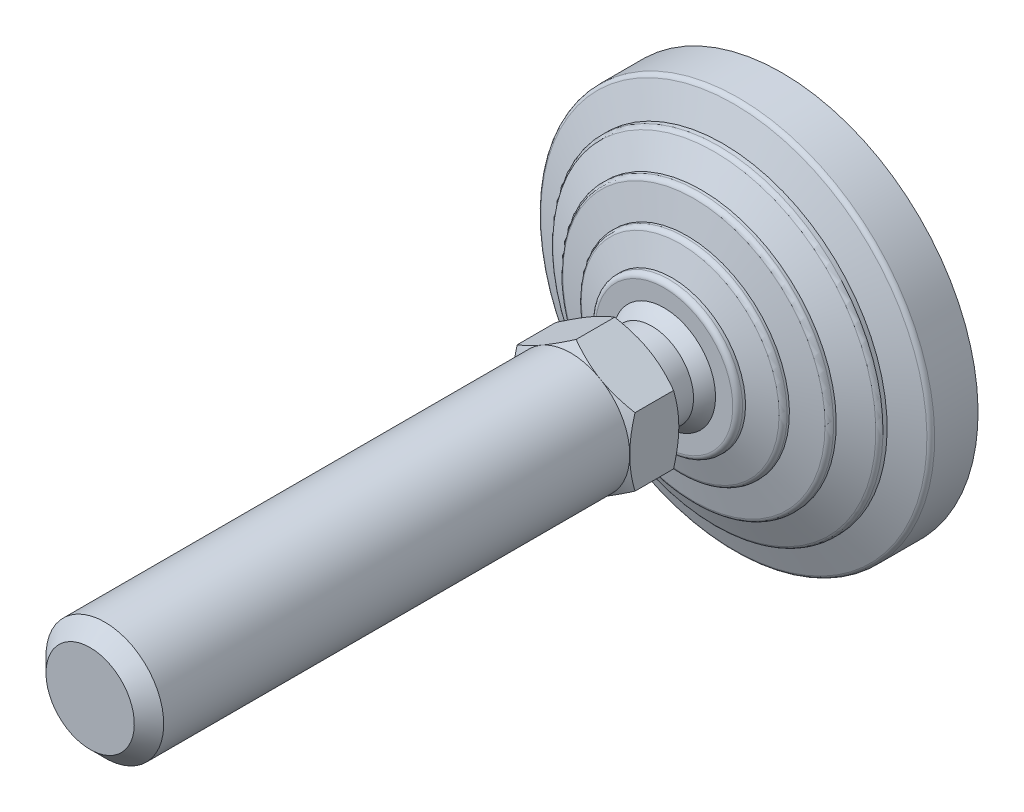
ISO-10303-21;
HEADER;
FILE_DESCRIPTION(('STEP AP214'),'2;1');
FILE_NAME('part.step','',(''),(''),'','','');
FILE_SCHEMA(('AUTOMOTIVE_DESIGN { 1 0 10303 214 1 1 1 1 }'));
ENDSEC;
DATA;
#1=APPLICATION_CONTEXT('core data for automotive mechanical design processes');
#2=APPLICATION_PROTOCOL_DEFINITION('international standard','automotive_design',2000,#1);
#3=PRODUCT_CONTEXT('',#1,'mechanical');
#4=PRODUCT('Part','Part','',(#3));
#5=PRODUCT_RELATED_PRODUCT_CATEGORY('part','',(#4));
#6=PRODUCT_DEFINITION_FORMATION('','',#4);
#7=PRODUCT_DEFINITION_CONTEXT('part definition',#1,'design');
#8=PRODUCT_DEFINITION('design','',#6,#7);
#9=PRODUCT_DEFINITION_SHAPE('','',#8);
#10=(LENGTH_UNIT() NAMED_UNIT(*) SI_UNIT(.MILLI.,.METRE.));
#11=(NAMED_UNIT(*) PLANE_ANGLE_UNIT() SI_UNIT($,.RADIAN.));
#12=(NAMED_UNIT(*) SI_UNIT($,.STERADIAN.) SOLID_ANGLE_UNIT());
#13=UNCERTAINTY_MEASURE_WITH_UNIT(LENGTH_MEASURE(1.E-05),#10,'distance_accuracy_value','');
#14=(GEOMETRIC_REPRESENTATION_CONTEXT(3) GLOBAL_UNCERTAINTY_ASSIGNED_CONTEXT((#13)) GLOBAL_UNIT_ASSIGNED_CONTEXT((#10,
#11,#12)) REPRESENTATION_CONTEXT('',''));
#15=CARTESIAN_POINT('',(0.,0.,0.));
#16=DIRECTION('',(0.,0.,1.));
#17=DIRECTION('',(1.,0.,0.));
#18=AXIS2_PLACEMENT_3D('',#15,#16,#17);
#19=CARTESIAN_POINT('',(-8.4999999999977,0.,32.9999999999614));
#20=DIRECTION('',(0.,0.,1.));
#21=DIRECTION('',(0.,-1.,0.));
#22=AXIS2_PLACEMENT_3D('',#19,#20,#21);
#23=PLANE('',#22);
#24=CARTESIAN_POINT('',(0.,0.,32.9999999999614));
#25=DIRECTION('',(0.,0.,-1.));
#26=DIRECTION('',(0.,1.,0.));
#27=AXIS2_PLACEMENT_3D('',#24,#25,#26);
#28=CIRCLE('',#27,8.4999999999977);
#29=CARTESIAN_POINT('',(0.,8.4999999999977,32.9999999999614));
#30=VERTEX_POINT('',#29);
#31=EDGE_CURVE('E337',#30,#30,#28,.T.);
#32=ORIENTED_EDGE('',*,*,#31,.F.);
#33=EDGE_LOOP('',(#32));
#34=FACE_BOUND('',#33,.T.);
#35=CARTESIAN_POINT('',(0.,0.,32.9999999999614));
#36=DIRECTION('',(0.,0.,-1.));
#37=DIRECTION('',(-1.,0.,0.));
#38=AXIS2_PLACEMENT_3D('',#35,#36,#37);
#39=CIRCLE('',#38,11.9999999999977);
#40=CARTESIAN_POINT('',(6.,10.3923048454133,32.9999999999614));
#41=VERTEX_POINT('',#40);
#42=CARTESIAN_POINT('',(12.,0.,32.9999999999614));
#43=VERTEX_POINT('',#42);
#44=EDGE_CURVE('E493',#41,#43,#39,.T.);
#45=ORIENTED_EDGE('',*,*,#44,.T.);
#46=CARTESIAN_POINT('',(6.,-10.3923048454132,32.9999999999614));
#47=VERTEX_POINT('',#46);
#48=EDGE_CURVE('E140',#43,#47,#39,.T.);
#49=ORIENTED_EDGE('',*,*,#48,.T.);
#50=CARTESIAN_POINT('',(-6.,-10.3923048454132,32.9999999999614));
#51=VERTEX_POINT('',#50);
#52=EDGE_CURVE('E139',#47,#51,#39,.T.);
#53=ORIENTED_EDGE('',*,*,#52,.T.);
#54=CARTESIAN_POINT('',(-12.,0.,32.9999999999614));
#55=VERTEX_POINT('',#54);
#56=EDGE_CURVE('E117',#51,#55,#39,.T.);
#57=ORIENTED_EDGE('',*,*,#56,.T.);
#58=CARTESIAN_POINT('',(-6.,10.3923048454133,32.9999999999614));
#59=VERTEX_POINT('',#58);
#60=EDGE_CURVE('E105',#55,#59,#39,.T.);
#61=ORIENTED_EDGE('',*,*,#60,.T.);
#62=EDGE_CURVE('E34',#59,#41,#39,.T.);
#63=ORIENTED_EDGE('',*,*,#62,.T.);
#64=EDGE_LOOP('',(#45,#49,#53,#57,#61,#63));
#65=FACE_BOUND('',#64,.T.);
#66=ADVANCED_FACE('F14',(#34,#65),#23,.F.);
#67=CARTESIAN_POINT('',(0.,0.,0.));
#68=DIRECTION('',(0.,0.,-1.));
#69=DIRECTION('',(0.,1.,0.));
#70=AXIS2_PLACEMENT_3D('',#67,#68,#69);
#71=CYLINDRICAL_SURFACE('',#70,8.4999999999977);
#72=CARTESIAN_POINT('',(0.,0.,26.4999999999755));
#73=DIRECTION('',(0.,0.,-1.));
#74=DIRECTION('',(0.,1.,0.));
#75=AXIS2_PLACEMENT_3D('',#72,#73,#74);
#76=CIRCLE('',#75,8.4999999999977);
#77=CARTESIAN_POINT('',(0.,8.4999999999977,26.4999999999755));
#78=VERTEX_POINT('',#77);
#79=EDGE_CURVE('E340',#78,#78,#76,.T.);
#80=ORIENTED_EDGE('',*,*,#79,.F.);
#81=EDGE_LOOP('',(#80));
#82=FACE_BOUND('',#81,.T.);
#83=ORIENTED_EDGE('',*,*,#31,.T.);
#84=EDGE_LOOP('',(#83));
#85=FACE_BOUND('',#84,.T.);
#86=ADVANCED_FACE('F305',(#82,#85),#71,.T.);
#87=CARTESIAN_POINT('',(-8.4999999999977,0.,26.4999999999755));
#88=DIRECTION('',(0.,0.,1.));
#89=DIRECTION('',(0.,-1.,0.));
#90=AXIS2_PLACEMENT_3D('',#87,#88,#89);
#91=PLANE('',#90);
#92=CARTESIAN_POINT('',(0.,0.,26.4999999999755));
#93=DIRECTION('',(0.,0.,-1.));
#94=DIRECTION('',(0.,1.,0.));
#95=AXIS2_PLACEMENT_3D('',#92,#93,#94);
#96=CIRCLE('',#95,8.49107182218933);
#97=CARTESIAN_POINT('',(-8.49107182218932,0.,26.4999999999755));
#98=VERTEX_POINT('',#97);
#99=EDGE_CURVE('E343',#98,#98,#96,.T.);
#100=ORIENTED_EDGE('',*,*,#99,.F.);
#101=EDGE_LOOP('',(#100));
#102=FACE_BOUND('',#101,.T.);
#103=ORIENTED_EDGE('',*,*,#79,.T.);
#104=EDGE_LOOP('',(#103));
#105=FACE_BOUND('',#104,.T.);
#106=ADVANCED_FACE('F301',(#102,#105),#91,.F.);
#107=CARTESIAN_POINT('',(-2.80331313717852E-12,0.,17.6702661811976));
#108=DIRECTION('',(0.,0.,-1.));
#109=DIRECTION('',(-1.,0.,0.));
#110=AXIS2_PLACEMENT_3D('',#107,#108,#109);
#111=SPHERICAL_SURFACE('',#110,12.25);
#112=CARTESIAN_POINT('',(0.,0.,24.));
#113=DIRECTION('',(0.,0.,-1.));
#114=DIRECTION('',(0.,1.,0.));
#115=AXIS2_PLACEMENT_3D('',#112,#113,#114);
#116=CIRCLE('',#115,10.4879440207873);
#117=CARTESIAN_POINT('',(-10.4879440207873,0.,24.));
#118=VERTEX_POINT('',#117);
#119=EDGE_CURVE('E346',#118,#118,#116,.T.);
#120=CARTESIAN_POINT('',(-10.4879440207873,0.,24.));
#121=CARTESIAN_POINT('',(-10.4706730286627,0.,24.0286168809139));
#122=CARTESIAN_POINT('',(-10.4532849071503,0.,24.0571630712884));
#123=CARTESIAN_POINT('',(-10.4182755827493,0.,24.1141121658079));
#124=CARTESIAN_POINT('',(-10.4006543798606,0.,24.1425150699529));
#125=CARTESIAN_POINT('',(-10.3651800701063,0.,24.1991756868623));
#126=CARTESIAN_POINT('',(-10.3473269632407,0.,24.2274333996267));
#127=CARTESIAN_POINT('',(-10.3113900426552,0.,24.283801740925));
#128=CARTESIAN_POINT('',(-10.2933062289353,0.,24.3119123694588));
#129=CARTESIAN_POINT('',(-10.2569091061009,0.,24.367984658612));
#130=CARTESIAN_POINT('',(-10.2385957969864,0.,24.3959463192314));
#131=CARTESIAN_POINT('',(-10.2017409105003,0.,24.4517187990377));
#132=CARTESIAN_POINT('',(-10.1831993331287,0.,24.4795296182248));
#133=CARTESIAN_POINT('',(-10.1458891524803,0.,24.5349985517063));
#134=CARTESIAN_POINT('',(-10.1271205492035,0.,24.5626566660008));
#135=CARTESIAN_POINT('',(-10.0893575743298,0.,24.6178183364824));
#136=CARTESIAN_POINT('',(-10.0703632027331,0.,24.6453218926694));
#137=CARTESIAN_POINT('',(-10.0321499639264,0.,24.7001726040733));
#138=CARTESIAN_POINT('',(-10.0129310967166,0.,24.7275197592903));
#139=CARTESIAN_POINT('',(-9.97427015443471,0.,24.7820558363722));
#140=CARTESIAN_POINT('',(-9.95482807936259,0.,24.8092447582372));
#141=CARTESIAN_POINT('',(-9.91572202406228,0.,24.8634625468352));
#142=CARTESIAN_POINT('',(-9.89605804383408,0.,24.8904914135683));
#143=CARTESIAN_POINT('',(-9.85650949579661,0.,24.9443872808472));
#144=CARTESIAN_POINT('',(-9.83662492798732,0.,24.9712542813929));
#145=CARTESIAN_POINT('',(-9.79663653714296,0.,25.0248246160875));
#146=CARTESIAN_POINT('',(-9.7765327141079,0.,25.0515279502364));
#147=CARTESIAN_POINT('',(-9.73610715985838,0.,25.1047691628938));
#148=CARTESIAN_POINT('',(-9.71578542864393,0.,25.1313070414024));
#149=CARTESIAN_POINT('',(-9.67492541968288,0.,25.1842155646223));
#150=CARTESIAN_POINT('',(-9.65438714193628,0.,25.2105862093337));
#151=CARTESIAN_POINT('',(-9.61309541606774,0.,25.2631584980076));
#152=CARTESIAN_POINT('',(-9.5923419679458,0.,25.2893601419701));
#153=CARTESIAN_POINT('',(-9.55062129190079,0.,25.3415926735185));
#154=CARTESIAN_POINT('',(-9.52965406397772,0.,25.3676235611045));
#155=CARTESIAN_POINT('',(-9.48750723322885,0.,25.4195128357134));
#156=CARTESIAN_POINT('',(-9.46632763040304,0.,25.4453712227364));
#157=CARTESIAN_POINT('',(-9.42375746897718,0.,25.4969137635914));
#158=CARTESIAN_POINT('',(-9.40236691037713,0.,25.5225979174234));
#159=CARTESIAN_POINT('',(-9.35937627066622,0.,25.5737902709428));
#160=CARTESIAN_POINT('',(-9.33777618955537,0.,25.5992984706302));
#161=CARTESIAN_POINT('',(-9.29436795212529,0.,25.6501372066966));
#162=CARTESIAN_POINT('',(-9.27255979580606,0.,25.6754677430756));
#163=CARTESIAN_POINT('',(-9.2287368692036,0.,25.7259494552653));
#164=CARTESIAN_POINT('',(-9.20672209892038,0.,25.7511006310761));
#165=CARTESIAN_POINT('',(-9.16248741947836,0.,25.8012219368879));
#166=CARTESIAN_POINT('',(-9.14026751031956,0.,25.8261920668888));
#167=CARTESIAN_POINT('',(-9.09562404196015,0.,25.8759496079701));
#168=CARTESIAN_POINT('',(-9.07320048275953,0.,25.9007370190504));
#169=CARTESIAN_POINT('',(-9.02815121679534,0.,25.9501274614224));
#170=CARTESIAN_POINT('',(-9.00552551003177,0.,25.974730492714));
#171=CARTESIAN_POINT('',(-8.96007346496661,0.,26.0237505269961));
#172=CARTESIAN_POINT('',(-8.93724712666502,0.,26.0481675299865));
#173=CARTESIAN_POINT('',(-8.89139534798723,0.,26.0968138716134));
#174=CARTESIAN_POINT('',(-8.86836990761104,0.,26.1210432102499));
#175=CARTESIAN_POINT('',(-8.82212146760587,0.,26.1693125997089));
#176=CARTESIAN_POINT('',(-8.7988984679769,0.,26.1933526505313));
#177=CARTESIAN_POINT('',(-8.75225646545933,0.,26.2412418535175));
#178=CARTESIAN_POINT('',(-8.72883746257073,0.,26.2650910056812));
#179=CARTESIAN_POINT('',(-8.68180502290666,0.,26.3125968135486));
#180=CARTESIAN_POINT('',(-8.6581915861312,0.,26.3362534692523));
#181=CARTESIAN_POINT('',(-8.61077186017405,0.,26.3833726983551));
#182=CARTESIAN_POINT('',(-8.58696557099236,0.,26.4068352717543));
#183=CARTESIAN_POINT('',(-8.53916173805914,0.,26.4535647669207));
#184=CARTESIAN_POINT('',(-8.5151641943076,0.,26.4768316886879));
#185=CARTESIAN_POINT('',(-8.49107182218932,0.,26.4999999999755));
#186=B_SPLINE_CURVE_WITH_KNOTS('',3,(#120,#121,#122,#123,#124,#125,#126,#127,#128,#129,#130,
#131,#132,#133,#134,#135,#136,#137,#138,#139,#140,#141,#142,#143,#144,#145,#146,#147,#148,#149,
#150,#151,#152,#153,#154,#155,#156,#157,#158,#159,#160,#161,#162,#163,#164,#165,#166,#167,#168,
#169,#170,#171,#172,#173,#174,#175,#176,#177,#178,#179,#180,#181,#182,#183,#184,#185),
.UNSPECIFIED.,.F.,.F.,(4,2,2,2,2,2,2,2,2,2,2,2,2,2,2,2,2,2,2,2,2,2,2,2,2,2,2,2,2,2,2,2,4),(0.,
0.100273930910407,0.200547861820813,0.300821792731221,0.401095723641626,0.501369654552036,
0.601643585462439,0.701917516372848,0.802191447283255,0.902465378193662,1.00273930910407,
1.10301324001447,1.20328717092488,1.30356110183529,1.4038350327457,1.5041089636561,
1.60438289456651,1.70465682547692,1.80493075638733,1.90520468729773,2.00547861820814,
2.10575254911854,2.20602648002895,2.30630041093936,2.40657434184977,2.50684827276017,
2.60712220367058,2.70739613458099,2.80767006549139,2.9079439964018,3.00821792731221,
3.10849185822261,3.20876578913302),.UNSPECIFIED.);
#187=EDGE_CURVE('BSEAM297',#118,#98,#186,.T.);
#188=ORIENTED_EDGE('',*,*,#119,.F.);
#189=ORIENTED_EDGE('',*,*,#99,.T.);
#190=ORIENTED_EDGE('',*,*,#187,.T.);
#191=ORIENTED_EDGE('',*,*,#187,.F.);
#192=EDGE_LOOP('',(#188,#190,#189,#191));
#193=FACE_BOUND('',#192,.T.);
#194=ADVANCED_FACE('F297',(#193),#111,.T.);
#195=CARTESIAN_POINT('',(-10.4879440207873,0.,24.));
#196=DIRECTION('',(0.,0.,-1.));
#197=DIRECTION('',(0.,1.,0.));
#198=AXIS2_PLACEMENT_3D('',#195,#196,#197);
#199=PLANE('',#198);
#200=CARTESIAN_POINT('',(0.,0.,24.));
#201=DIRECTION('',(0.,0.,-1.));
#202=DIRECTION('',(0.,1.,0.));
#203=AXIS2_PLACEMENT_3D('',#200,#201,#202);
#204=CIRCLE('',#203,13.9999999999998);
#205=CARTESIAN_POINT('',(0.,13.9999999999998,24.));
#206=VERTEX_POINT('',#205);
#207=EDGE_CURVE('E349',#206,#206,#204,.T.);
#208=ORIENTED_EDGE('',*,*,#207,.F.);
#209=EDGE_LOOP('',(#208));
#210=FACE_BOUND('',#209,.T.);
#211=ORIENTED_EDGE('',*,*,#119,.T.);
#212=EDGE_LOOP('',(#211));
#213=FACE_BOUND('',#212,.T.);
#214=ADVANCED_FACE('F293',(#210,#213),#199,.F.);
#215=CARTESIAN_POINT('',(0.,0.,23.));
#216=DIRECTION('',(0.,0.,-1.));
#217=DIRECTION('',(0.,1.,0.));
#218=AXIS2_PLACEMENT_3D('',#215,#216,#217);
#219=TOROIDAL_SURFACE('',#218,13.9999999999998,1.);
#220=CARTESIAN_POINT('',(0.,0.,23.));
#221=DIRECTION('',(0.,0.,-1.));
#222=DIRECTION('',(0.,1.,0.));
#223=AXIS2_PLACEMENT_3D('',#220,#221,#222);
#224=CIRCLE('',#223,14.9999999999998);
#225=CARTESIAN_POINT('',(0.,14.9999999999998,23.));
#226=VERTEX_POINT('',#225);
#227=EDGE_CURVE('E352',#226,#226,#224,.T.);
#228=ORIENTED_EDGE('',*,*,#227,.F.);
#229=EDGE_LOOP('',(#228));
#230=FACE_BOUND('',#229,.T.);
#231=ORIENTED_EDGE('',*,*,#207,.T.);
#232=EDGE_LOOP('',(#231));
#233=FACE_BOUND('',#232,.T.);
#234=ADVANCED_FACE('F289',(#230,#233),#219,.T.);
#235=CARTESIAN_POINT('',(0.,0.,0.));
#236=DIRECTION('',(0.,0.,-1.));
#237=DIRECTION('',(0.,1.,0.));
#238=AXIS2_PLACEMENT_3D('',#235,#236,#237);
#239=CYLINDRICAL_SURFACE('',#238,14.9999999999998);
#240=CARTESIAN_POINT('',(0.,0.,22.4025287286));
#241=DIRECTION('',(0.,0.,-1.));
#242=DIRECTION('',(0.,1.,0.));
#243=AXIS2_PLACEMENT_3D('',#240,#241,#242);
#244=CIRCLE('',#243,14.9999999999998);
#245=CARTESIAN_POINT('',(0.,14.9999999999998,22.4025287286));
#246=VERTEX_POINT('',#245);
#247=EDGE_CURVE('E355',#246,#246,#244,.T.);
#248=ORIENTED_EDGE('',*,*,#247,.F.);
#249=EDGE_LOOP('',(#248));
#250=FACE_BOUND('',#249,.T.);
#251=ORIENTED_EDGE('',*,*,#227,.T.);
#252=EDGE_LOOP('',(#251));
#253=FACE_BOUND('',#252,.T.);
#254=ADVANCED_FACE('F285',(#250,#253),#239,.T.);
#255=CARTESIAN_POINT('',(0.,0.,22.4025287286));
#256=DIRECTION('',(0.,0.,-1.));
#257=DIRECTION('',(0.,1.,0.));
#258=AXIS2_PLACEMENT_3D('',#255,#256,#257);
#259=CONICAL_SURFACE('',#258,14.9999999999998,1.25589726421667);
#260=CARTESIAN_POINT('',(0.,0.,20.7216684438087));
#261=DIRECTION('',(0.,0.,-1.));
#262=DIRECTION('',(0.,1.,0.));
#263=AXIS2_PLACEMENT_3D('',#260,#261,#262);
#264=CIRCLE('',#263,20.1601635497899);
#265=CARTESIAN_POINT('',(0.,20.1601635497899,20.7216684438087));
#266=VERTEX_POINT('',#265);
#267=EDGE_CURVE('E358',#266,#266,#264,.T.);
#268=ORIENTED_EDGE('',*,*,#267,.F.);
#269=EDGE_LOOP('',(#268));
#270=FACE_BOUND('',#269,.T.);
#271=ORIENTED_EDGE('',*,*,#247,.T.);
#272=EDGE_LOOP('',(#271));
#273=FACE_BOUND('',#272,.T.);
#274=ADVANCED_FACE('F281',(#270,#273),#259,.T.);
#275=CARTESIAN_POINT('',(0.,0.,19.7708407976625));
#276=DIRECTION('',(0.,0.,-1.));
#277=DIRECTION('',(0.,1.,0.));
#278=AXIS2_PLACEMENT_3D('',#275,#276,#277);
#279=TOROIDAL_SURFACE('',#278,19.8504430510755,1.);
#280=CARTESIAN_POINT('',(0.,0.,19.7708407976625));
#281=DIRECTION('',(0.,0.,-1.));
#282=DIRECTION('',(0.,1.,0.));
#283=AXIS2_PLACEMENT_3D('',#280,#281,#282);
#284=CIRCLE('',#283,20.8504430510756);
#285=CARTESIAN_POINT('',(0.,20.8504430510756,19.7708407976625));
#286=VERTEX_POINT('',#285);
#287=EDGE_CURVE('E361',#286,#286,#284,.T.);
#288=ORIENTED_EDGE('',*,*,#287,.F.);
#289=EDGE_LOOP('',(#288));
#290=FACE_BOUND('',#289,.T.);
#291=ORIENTED_EDGE('',*,*,#267,.T.);
#292=EDGE_LOOP('',(#291));
#293=FACE_BOUND('',#292,.T.);
#294=ADVANCED_FACE('F277',(#290,#293),#279,.T.);
#295=CARTESIAN_POINT('',(0.,0.,0.));
#296=DIRECTION('',(0.,0.,-1.));
#297=DIRECTION('',(0.,1.,0.));
#298=AXIS2_PLACEMENT_3D('',#295,#296,#297);
#299=CYLINDRICAL_SURFACE('',#298,20.8504430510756);
#300=CARTESIAN_POINT('',(0.,0.,19.2987385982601));
#301=DIRECTION('',(0.,0.,-1.));
#302=DIRECTION('',(0.,1.,0.));
#303=AXIS2_PLACEMENT_3D('',#300,#301,#302);
#304=CIRCLE('',#303,20.8504430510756);
#305=CARTESIAN_POINT('',(0.,20.8504430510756,19.2987385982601));
#306=VERTEX_POINT('',#305);
#307=EDGE_CURVE('E364',#306,#306,#304,.T.);
#308=ORIENTED_EDGE('',*,*,#307,.F.);
#309=EDGE_LOOP('',(#308));
#310=FACE_BOUND('',#309,.T.);
#311=ORIENTED_EDGE('',*,*,#287,.T.);
#312=EDGE_LOOP('',(#311));
#313=FACE_BOUND('',#312,.T.);
#314=ADVANCED_FACE('F273',(#310,#313),#299,.T.);
#315=CARTESIAN_POINT('',(0.,0.,19.2987385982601));
#316=DIRECTION('',(0.,0.,-1.));
#317=DIRECTION('',(0.,1.,0.));
#318=AXIS2_PLACEMENT_3D('',#315,#316,#317);
#319=CONICAL_SURFACE('',#318,20.8504430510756,1.34067144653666);
#320=CARTESIAN_POINT('',(0.,0.,17.9217501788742));
#321=DIRECTION('',(0.,0.,-1.));
#322=DIRECTION('',(0.,1.,0.));
#323=AXIS2_PLACEMENT_3D('',#320,#321,#322);
#324=CIRCLE('',#323,26.7280991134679);
#325=CARTESIAN_POINT('',(0.,26.7280991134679,17.9217501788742));
#326=VERTEX_POINT('',#325);
#327=EDGE_CURVE('E367',#326,#326,#324,.T.);
#328=ORIENTED_EDGE('',*,*,#327,.F.);
#329=EDGE_LOOP('',(#328));
#330=FACE_BOUND('',#329,.T.);
#331=ORIENTED_EDGE('',*,*,#307,.T.);
#332=EDGE_LOOP('',(#331));
#333=FACE_BOUND('',#332,.T.);
#334=ADVANCED_FACE('F269',(#330,#333),#319,.T.);
#335=CARTESIAN_POINT('',(0.,0.,16.9481122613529));
#336=DIRECTION('',(0.,0.,-1.));
#337=DIRECTION('',(0.,1.,0.));
#338=AXIS2_PLACEMENT_3D('',#335,#336,#337);
#339=TOROIDAL_SURFACE('',#338,26.5,1.);
#340=CARTESIAN_POINT('',(0.,0.,16.9481122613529));
#341=DIRECTION('',(0.,0.,-1.));
#342=DIRECTION('',(0.,1.,0.));
#343=AXIS2_PLACEMENT_3D('',#340,#341,#342);
#344=CIRCLE('',#343,27.5);
#345=CARTESIAN_POINT('',(0.,27.5,16.9481122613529));
#346=VERTEX_POINT('',#345);
#347=EDGE_CURVE('E370',#346,#346,#344,.T.);
#348=ORIENTED_EDGE('',*,*,#347,.F.);
#349=EDGE_LOOP('',(#348));
#350=FACE_BOUND('',#349,.T.);
#351=ORIENTED_EDGE('',*,*,#327,.T.);
#352=EDGE_LOOP('',(#351));
#353=FACE_BOUND('',#352,.T.);
#354=ADVANCED_FACE('F265',(#350,#353),#339,.T.);
#355=CARTESIAN_POINT('',(0.,0.,0.));
#356=DIRECTION('',(0.,0.,-1.));
#357=DIRECTION('',(0.,1.,0.));
#358=AXIS2_PLACEMENT_3D('',#355,#356,#357);
#359=CYLINDRICAL_SURFACE('',#358,27.5);
#360=CARTESIAN_POINT('',(0.,0.,16.4025287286));
#361=DIRECTION('',(0.,0.,-1.));
#362=DIRECTION('',(0.,1.,0.));
#363=AXIS2_PLACEMENT_3D('',#360,#361,#362);
#364=CIRCLE('',#363,27.5);
#365=CARTESIAN_POINT('',(0.,27.5,16.4025287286));
#366=VERTEX_POINT('',#365);
#367=EDGE_CURVE('E373',#366,#366,#364,.T.);
#368=ORIENTED_EDGE('',*,*,#367,.F.);
#369=EDGE_LOOP('',(#368));
#370=FACE_BOUND('',#369,.T.);
#371=ORIENTED_EDGE('',*,*,#347,.T.);
#372=EDGE_LOOP('',(#371));
#373=FACE_BOUND('',#372,.T.);
#374=ADVANCED_FACE('F261',(#370,#373),#359,.T.);
#375=CARTESIAN_POINT('',(0.,0.,16.4025287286));
#376=DIRECTION('',(0.,0.,-1.));
#377=DIRECTION('',(0.,1.,0.));
#378=AXIS2_PLACEMENT_3D('',#375,#376,#377);
#379=CONICAL_SURFACE('',#378,27.5,1.12022914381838);
#380=CARTESIAN_POINT('',(0.,0.,13.773091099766));
#381=DIRECTION('',(0.,0.,-1.));
#382=DIRECTION('',(0.,1.,0.));
#383=AXIS2_PLACEMENT_3D('',#380,#381,#382);
#384=CIRCLE('',#383,32.935476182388);
#385=CARTESIAN_POINT('',(0.,32.935476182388,13.773091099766));
#386=VERTEX_POINT('',#385);
#387=EDGE_CURVE('E376',#386,#386,#384,.T.);
#388=ORIENTED_EDGE('',*,*,#387,.F.);
#389=EDGE_LOOP('',(#388));
#390=FACE_BOUND('',#389,.T.);
#391=ORIENTED_EDGE('',*,*,#367,.T.);
#392=EDGE_LOOP('',(#391));
#393=FACE_BOUND('',#392,.T.);
#394=ADVANCED_FACE('F257',(#390,#393),#379,.T.);
#395=CARTESIAN_POINT('',(0.,0.,12.8728908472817));
#396=DIRECTION('',(0.,0.,-1.));
#397=DIRECTION('',(0.,1.,0.));
#398=AXIS2_PLACEMENT_3D('',#395,#396,#397);
#399=TOROIDAL_SURFACE('',#398,32.5,1.);
#400=CARTESIAN_POINT('',(0.,0.,12.8728908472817));
#401=DIRECTION('',(0.,0.,-1.));
#402=DIRECTION('',(0.,1.,0.));
#403=AXIS2_PLACEMENT_3D('',#400,#401,#402);
#404=CIRCLE('',#403,33.5);
#405=CARTESIAN_POINT('',(0.,33.5,12.8728908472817));
#406=VERTEX_POINT('',#405);
#407=EDGE_CURVE('E379',#406,#406,#404,.T.);
#408=ORIENTED_EDGE('',*,*,#407,.F.);
#409=EDGE_LOOP('',(#408));
#410=FACE_BOUND('',#409,.T.);
#411=ORIENTED_EDGE('',*,*,#387,.T.);
#412=EDGE_LOOP('',(#411));
#413=FACE_BOUND('',#412,.T.);
#414=ADVANCED_FACE('F253',(#410,#413),#399,.T.);
#415=CARTESIAN_POINT('',(0.,0.,0.));
#416=DIRECTION('',(0.,0.,-1.));
#417=DIRECTION('',(0.,1.,0.));
#418=AXIS2_PLACEMENT_3D('',#415,#416,#417);
#419=CYLINDRICAL_SURFACE('',#418,33.5);
#420=CARTESIAN_POINT('',(0.,0.,12.0315037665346));
#421=DIRECTION('',(0.,0.,-1.));
#422=DIRECTION('',(0.,1.,0.));
#423=AXIS2_PLACEMENT_3D('',#420,#421,#422);
#424=CIRCLE('',#423,33.5);
#425=CARTESIAN_POINT('',(0.,33.5,12.0315037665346));
#426=VERTEX_POINT('',#425);
#427=EDGE_CURVE('E382',#426,#426,#424,.T.);
#428=ORIENTED_EDGE('',*,*,#427,.F.);
#429=EDGE_LOOP('',(#428));
#430=FACE_BOUND('',#429,.T.);
#431=ORIENTED_EDGE('',*,*,#407,.T.);
#432=EDGE_LOOP('',(#431));
#433=FACE_BOUND('',#432,.T.);
#434=ADVANCED_FACE('F249',(#430,#433),#419,.T.);
#435=CARTESIAN_POINT('',(0.,0.,12.0315037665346));
#436=DIRECTION('',(0.,0.,-1.));
#437=DIRECTION('',(0.,1.,0.));
#438=AXIS2_PLACEMENT_3D('',#435,#436,#437);
#439=CONICAL_SURFACE('',#438,33.5,1.20362249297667);
#440=CARTESIAN_POINT('',(0.,0.,9.77805027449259));
#441=DIRECTION('',(0.,0.,-1.));
#442=DIRECTION('',(0.,1.,0.));
#443=AXIS2_PLACEMENT_3D('',#440,#441,#442);
#444=CIRCLE('',#443,39.3589790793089);
#445=CARTESIAN_POINT('',(0.,39.3589790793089,9.77805027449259));
#446=VERTEX_POINT('',#445);
#447=EDGE_CURVE('E385',#446,#446,#444,.T.);
#448=ORIENTED_EDGE('',*,*,#447,.F.);
#449=EDGE_LOOP('',(#448));
#450=FACE_BOUND('',#449,.T.);
#451=ORIENTED_EDGE('',*,*,#427,.T.);
#452=EDGE_LOOP('',(#451));
#453=FACE_BOUND('',#452,.T.);
#454=ADVANCED_FACE('F245',(#450,#453),#439,.T.);
#455=CARTESIAN_POINT('',(0.,0.,8.84470466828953));
#456=DIRECTION('',(0.,0.,-1.));
#457=DIRECTION('',(0.,1.,0.));
#458=AXIS2_PLACEMENT_3D('',#455,#456,#457);
#459=TOROIDAL_SURFACE('',#458,39.,1.);
#460=CARTESIAN_POINT('',(0.,0.,8.84470466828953));
#461=DIRECTION('',(0.,0.,-1.));
#462=DIRECTION('',(0.,1.,0.));
#463=AXIS2_PLACEMENT_3D('',#460,#461,#462);
#464=CIRCLE('',#463,40.);
#465=CARTESIAN_POINT('',(0.,40.,8.84470466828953));
#466=VERTEX_POINT('',#465);
#467=EDGE_CURVE('E388',#466,#466,#464,.T.);
#468=ORIENTED_EDGE('',*,*,#467,.F.);
#469=EDGE_LOOP('',(#468));
#470=FACE_BOUND('',#469,.T.);
#471=ORIENTED_EDGE('',*,*,#447,.T.);
#472=EDGE_LOOP('',(#471));
#473=FACE_BOUND('',#472,.T.);
#474=ADVANCED_FACE('F241',(#470,#473),#459,.T.);
#475=CARTESIAN_POINT('',(0.,0.,0.));
#476=DIRECTION('',(0.,0.,-1.));
#477=DIRECTION('',(0.,1.,0.));
#478=AXIS2_PLACEMENT_3D('',#475,#476,#477);
#479=CYLINDRICAL_SURFACE('',#478,40.);
#480=CARTESIAN_POINT('',(0.,0.,0.));
#481=DIRECTION('',(0.,0.,-1.));
#482=DIRECTION('',(0.,1.,0.));
#483=AXIS2_PLACEMENT_3D('',#480,#481,#482);
#484=CIRCLE('',#483,40.);
#485=CARTESIAN_POINT('',(0.,40.,0.));
#486=VERTEX_POINT('',#485);
#487=EDGE_CURVE('E391',#486,#486,#484,.T.);
#488=ORIENTED_EDGE('',*,*,#487,.F.);
#489=EDGE_LOOP('',(#488));
#490=FACE_BOUND('',#489,.T.);
#491=ORIENTED_EDGE('',*,*,#467,.T.);
#492=EDGE_LOOP('',(#491));
#493=FACE_BOUND('',#492,.T.);
#494=ADVANCED_FACE('F237',(#490,#493),#479,.T.);
#495=CARTESIAN_POINT('',(0.,0.,0.));
#496=DIRECTION('',(0.,0.,1.));
#497=DIRECTION('',(0.,-1.,0.));
#498=AXIS2_PLACEMENT_3D('',#495,#496,#497);
#499=PLANE('',#498);
#500=ORIENTED_EDGE('',*,*,#487,.T.);
#501=EDGE_LOOP('',(#500));
#502=FACE_BOUND('',#501,.T.);
#503=ADVANCED_FACE('F233',(#502),#499,.F.);
#504=CARTESIAN_POINT('',(0.,0.,35.682372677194));
#505=DIRECTION('',(0.,0.,1.));
#506=DIRECTION('',(1.,0.,0.));
#507=AXIS2_PLACEMENT_3D('',#504,#505,#506);
#508=CONICAL_SURFACE('',#507,16.646005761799,1.04719755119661);
#509=CARTESIAN_POINT('',(12.,-18.5989481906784,38.8509578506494));
#510=CARTESIAN_POINT('',(12.,-18.3369496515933,38.7238550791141));
#511=CARTESIAN_POINT('',(12.,-18.074643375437,38.597386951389));
#512=CARTESIAN_POINT('',(12.,-17.5493511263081,38.3458637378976));
#513=CARTESIAN_POINT('',(12.,-17.2863651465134,38.220808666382));
#514=CARTESIAN_POINT('',(12.,-16.4962211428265,37.8479456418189));
#515=CARTESIAN_POINT('',(12.,-15.9679547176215,37.6024776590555));
#516=CARTESIAN_POINT('',(12.,-14.9050028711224,37.1179440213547));
#517=CARTESIAN_POINT('',(12.,-14.3702981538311,36.8789205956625));
#518=CARTESIAN_POINT('',(12.,-13.2966326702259,36.4106659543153));
#519=CARTESIAN_POINT('',(12.,-12.7576721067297,36.18143427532));
#520=CARTESIAN_POINT('',(12.,-11.6572617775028,35.7281978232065));
#521=CARTESIAN_POINT('',(12.,-11.0956450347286,35.5045963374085));
#522=CARTESIAN_POINT('',(12.,-9.96583286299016,35.0743423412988));
#523=CARTESIAN_POINT('',(12.,-9.39763670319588,34.8676917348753));
#524=CARTESIAN_POINT('',(12.,-8.25484749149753,34.4767757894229));
#525=CARTESIAN_POINT('',(12.,-7.68027010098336,34.2924650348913));
#526=CARTESIAN_POINT('',(12.,-6.52281863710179,33.9521401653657));
#527=CARTESIAN_POINT('',(12.,-5.93994724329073,33.7961171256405));
#528=CARTESIAN_POINT('',(12.,-5.06093575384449,33.5893774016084));
#529=CARTESIAN_POINT('',(12.,-4.76795355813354,33.5251516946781));
#530=CARTESIAN_POINT('',(12.,-4.17998930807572,33.4065641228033));
#531=CARTESIAN_POINT('',(12.,-3.88500729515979,33.3522020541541));
#532=CARTESIAN_POINT('',(12.,-3.29324729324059,33.254301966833));
#533=CARTESIAN_POINT('',(12.,-2.99646932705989,33.2107638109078));
#534=CARTESIAN_POINT('',(12.,-2.40143320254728,33.1353805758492));
#535=CARTESIAN_POINT('',(12.,-2.10317510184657,33.1035350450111));
#536=CARTESIAN_POINT('',(12.,-1.50948433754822,33.0525682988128));
#537=CARTESIAN_POINT('',(12.,-1.21406553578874,33.0332865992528));
#538=CARTESIAN_POINT('',(12.,-0.622677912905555,33.0072325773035));
#539=CARTESIAN_POINT('',(12.,-0.326709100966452,33.0004600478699));
#540=CARTESIAN_POINT('',(12.,0.265250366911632,32.9995853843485));
#541=CARTESIAN_POINT('',(12.,0.561241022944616,33.0054833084));
#542=CARTESIAN_POINT('',(12.,1.15271069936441,33.029805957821));
#543=CARTESIAN_POINT('',(12.,1.44818969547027,33.048231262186));
#544=CARTESIAN_POINT('',(12.,2.15866441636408,33.1072057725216));
#545=CARTESIAN_POINT('',(12.,2.57317384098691,33.153718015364));
#546=CARTESIAN_POINT('',(12.,3.39911140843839,33.2688599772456));
#547=CARTESIAN_POINT('',(12.,3.81053912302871,33.337492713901));
#548=CARTESIAN_POINT('',(12.,4.6299232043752,33.4944341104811));
#549=CARTESIAN_POINT('',(12.,5.03787659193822,33.582758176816));
#550=CARTESIAN_POINT('',(12.,5.84968851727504,33.776387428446));
#551=CARTESIAN_POINT('',(12.,6.25354711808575,33.8816923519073));
#552=CARTESIAN_POINT('',(12.,7.06601801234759,34.1092012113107));
#553=CARTESIAN_POINT('',(12.,7.47454000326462,34.2317254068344));
#554=CARTESIAN_POINT('',(12.,8.28755956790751,34.4894009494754));
#555=CARTESIAN_POINT('',(12.,8.69205711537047,34.6245523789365));
#556=CARTESIAN_POINT('',(12.,9.49722800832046,34.905339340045));
#557=CARTESIAN_POINT('',(12.,9.89790258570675,35.0509713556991));
#558=CARTESIAN_POINT('',(12.,10.6959340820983,35.3510093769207));
#559=CARTESIAN_POINT('',(12.,11.0932910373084,35.5054152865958));
#560=CARTESIAN_POINT('',(12.,12.0199474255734,35.8754008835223));
#561=CARTESIAN_POINT('',(12.,12.5480791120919,36.0939006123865));
#562=CARTESIAN_POINT('',(12.,13.5999300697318,36.5413040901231));
#563=CARTESIAN_POINT('',(12.,14.1236490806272,36.7702084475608));
#564=CARTESIAN_POINT('',(12.,15.1674808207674,37.2363697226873));
#565=CARTESIAN_POINT('',(12.,15.6875927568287,37.473628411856));
#566=CARTESIAN_POINT('',(12.,16.7246905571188,37.9548393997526));
#567=CARTESIAN_POINT('',(12.,17.2416764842,38.1987915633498));
#568=CARTESIAN_POINT('',(12.,18.273578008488,38.6924166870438));
#569=CARTESIAN_POINT('',(12.,18.7884908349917,38.9420954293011));
#570=CARTESIAN_POINT('',(12.,19.8161071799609,39.4459577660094));
#571=CARTESIAN_POINT('',(12.,20.3288106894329,39.7001413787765));
#572=CARTESIAN_POINT('',(12.,21.3522801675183,40.2122195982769));
#573=CARTESIAN_POINT('',(12.,21.8630463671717,40.4701137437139));
#574=CARTESIAN_POINT('',(12.,22.8829809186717,40.9890442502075));
#575=CARTESIAN_POINT('',(12.,23.3921492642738,41.2500806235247));
#576=CARTESIAN_POINT('',(12.,24.8340367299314,41.9940388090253));
#577=CARTESIAN_POINT('',(12.,25.7651386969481,42.4800948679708));
#578=CARTESIAN_POINT('',(12.,27.6238566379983,43.4588870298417));
#579=CARTESIAN_POINT('',(12.,28.5514724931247,43.9516233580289));
#580=CARTESIAN_POINT('',(12.,30.4017164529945,44.9410222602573));
#581=CARTESIAN_POINT('',(12.,31.3243511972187,45.4376724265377));
#582=CARTESIAN_POINT('',(12.,32.7066531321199,46.1856350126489));
#583=CARTESIAN_POINT('',(12.,33.1671333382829,46.4354471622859));
#584=CARTESIAN_POINT('',(12.,34.0876052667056,46.9359681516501));
#585=CARTESIAN_POINT('',(12.,34.5475969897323,47.1866769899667));
#586=CARTESIAN_POINT('',(12.,35.0073719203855,47.4377828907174));
#587=B_SPLINE_CURVE_WITH_KNOTS('',3,(#509,#510,#511,#512,#513,#514,#515,#516,#517,#518,#519,
#520,#521,#522,#523,#524,#525,#526,#527,#528,#529,#530,#531,#532,#533,#534,#535,#536,#537,#538,
#539,#540,#541,#542,#543,#544,#545,#546,#547,#548,#549,#550,#551,#552,#553,#554,#555,#556,#557,
#558,#559,#560,#561,#562,#563,#564,#565,#566,#567,#568,#569,#570,#571,#572,#573,#574,#575,#576,
#577,#578,#579,#580,#581,#582,#583,#584,#585,#586),.UNSPECIFIED.,.F.,.F.,(4,2,2,2,2,2,2,2,2,2,2,
2,2,2,2,2,2,2,2,2,2,2,2,2,2,2,2,2,2,2,2,2,2,2,2,2,2,2,4),(0.,0.873603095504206,1.74721499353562,
3.49469786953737,5.25171329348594,7.00864548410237,8.82191359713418,10.6353850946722,
12.4451057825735,14.2542545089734,15.1539328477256,16.0535926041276,16.9532409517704,
17.8528545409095,18.740739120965,19.6286090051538,20.5164829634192,21.4043979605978,
22.6550381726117,23.9058490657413,25.1576420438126,26.4094157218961,27.688672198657,
28.9679370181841,30.246774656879,31.5255983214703,33.2400872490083,34.9546765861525,
36.6696317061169,38.3845522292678,40.101288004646,41.8180307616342,43.5345619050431,
45.2510997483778,48.4020605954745,51.5531279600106,54.6965594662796,56.2681926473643,
57.8398233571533),.UNSPECIFIED.);
#588=CARTESIAN_POINT('',(12.,6.92820323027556,34.0717967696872));
#589=VERTEX_POINT('',#588);
#590=EDGE_CURVE('E115',#589,#43,#587,.F.);
#591=ORIENTED_EDGE('',*,*,#590,.T.);
#592=ORIENTED_EDGE('',*,*,#44,.F.);
#593=CARTESIAN_POINT('',(-0.00019999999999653,13.8565219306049,34.0718634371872));
#594=CARTESIAN_POINT('',(0.263585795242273,13.7042251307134,33.9839496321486));
#595=CARTESIAN_POINT('',(0.528355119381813,13.5513604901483,33.9000259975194));
#596=CARTESIAN_POINT('',(1.06001701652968,13.2444053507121,33.7412662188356));
#597=CARTESIAN_POINT('',(1.32691025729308,13.0903144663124,33.6664330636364));
#598=CARTESIAN_POINT('',(2.13189040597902,12.6255589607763,33.4570175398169));
#599=CARTESIAN_POINT('',(2.67315507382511,12.3130596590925,33.3379032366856));
#600=CARTESIAN_POINT('',(3.48313282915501,11.8454187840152,33.1982310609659));
#601=CARTESIAN_POINT('',(3.74942610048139,11.6916742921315,33.1584437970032));
#602=CARTESIAN_POINT('',(4.28324559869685,11.3834734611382,33.0917233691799));
#603=CARTESIAN_POINT('',(4.5507718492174,11.2290171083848,33.0647904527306));
#604=CARTESIAN_POINT('',(5.08627036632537,10.9198468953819,33.0244685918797));
#605=CARTESIAN_POINT('',(5.35424172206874,10.7651335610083,33.0110635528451));
#606=CARTESIAN_POINT('',(5.89043273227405,10.4555635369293,32.99808309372));
#607=CARTESIAN_POINT('',(6.15865237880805,10.3007068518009,32.9985072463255));
#608=CARTESIAN_POINT('',(6.66008937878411,10.0112020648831,33.0122200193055));
#609=CARTESIAN_POINT('',(6.89334249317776,9.87653331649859,33.0238359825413));
#610=CARTESIAN_POINT('',(7.35931224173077,9.60750555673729,33.0573080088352));
#611=CARTESIAN_POINT('',(7.59202883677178,9.47314656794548,33.079164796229));
#612=CARTESIAN_POINT('',(8.05679907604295,9.20481134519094,33.1327374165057));
#613=CARTESIAN_POINT('',(8.28885201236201,9.07083551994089,33.1644613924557));
#614=CARTESIAN_POINT('',(8.75186996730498,8.80351197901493,33.2372117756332));
#615=CARTESIAN_POINT('',(8.98283491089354,8.67016430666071,33.278238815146));
#616=CARTESIAN_POINT('',(9.68394195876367,8.26537996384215,33.4163116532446));
#617=CARTESIAN_POINT('',(10.1520537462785,7.99511549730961,33.5271248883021));
#618=CARTESIAN_POINT('',(11.0812971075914,7.45861659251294,33.7786257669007));
#619=CARTESIAN_POINT('',(11.5424405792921,7.19237528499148,33.9192543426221));
#620=CARTESIAN_POINT('',(12.0002,6.92808776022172,34.0718634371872));
#621=B_SPLINE_CURVE_WITH_KNOTS('',3,(#593,#594,#595,#596,#597,#598,#599,#600,#601,#602,#603,
#604,#605,#606,#607,#608,#609,#610,#611,#612,#613,#614,#615,#616,#617,#618,#619,#620),
.UNSPECIFIED.,.F.,.F.,(4,2,2,2,2,2,2,2,2,2,2,2,2,4),(0.,0.951004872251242,1.90232158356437,
3.80900466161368,4.7389455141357,5.66890426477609,6.59775529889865,7.52657763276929,
8.33514643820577,9.14377244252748,9.95306755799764,10.7624176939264,12.4167102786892,
14.0677556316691),.UNSPECIFIED.);
#622=EDGE_CURVE('E18',#41,#589,#621,.T.);
#623=ORIENTED_EDGE('',*,*,#622,.T.);
#624=EDGE_LOOP('',(#591,#592,#623));
#625=FACE_BOUND('',#624,.T.);
#626=ADVANCED_FACE('F157',(#625),#508,.T.);
#627=CARTESIAN_POINT('',(-12.0002,6.92808776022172,34.0718634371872));
#628=CARTESIAN_POINT('',(-11.7364142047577,7.08038456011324,33.9839496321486));
#629=CARTESIAN_POINT('',(-11.4716448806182,7.23324920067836,33.9000259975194));
#630=CARTESIAN_POINT('',(-10.9399829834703,7.54020434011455,33.7412662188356));
#631=CARTESIAN_POINT('',(-10.6730897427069,7.69429522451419,33.6664330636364));
#632=CARTESIAN_POINT('',(-9.86810959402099,8.15905073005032,33.4570175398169));
#633=CARTESIAN_POINT('',(-9.32684492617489,8.4715500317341,33.3379032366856));
#634=CARTESIAN_POINT('',(-8.516867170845,8.93919090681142,33.1982310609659));
#635=CARTESIAN_POINT('',(-8.25057389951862,9.09293539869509,33.1584437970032));
#636=CARTESIAN_POINT('',(-7.71675440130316,9.40113622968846,33.0917233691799));
#637=CARTESIAN_POINT('',(-7.44922815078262,9.55559258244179,33.0647904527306));
#638=CARTESIAN_POINT('',(-6.91372963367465,9.86476279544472,33.0244685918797));
#639=CARTESIAN_POINT('',(-6.64575827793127,10.0194761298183,33.0110635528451));
#640=CARTESIAN_POINT('',(-6.10956726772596,10.3290461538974,32.99808309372));
#641=CARTESIAN_POINT('',(-5.84134762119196,10.4839028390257,32.9985072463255));
#642=CARTESIAN_POINT('',(-5.33991062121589,10.7734076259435,33.0122200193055));
#643=CARTESIAN_POINT('',(-5.10665750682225,10.908076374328,33.0238359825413));
#644=CARTESIAN_POINT('',(-4.64068775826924,11.1771041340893,33.0573080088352));
#645=CARTESIAN_POINT('',(-4.40797116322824,11.3114631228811,33.079164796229));
#646=CARTESIAN_POINT('',(-3.94320092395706,11.5797983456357,33.1327374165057));
#647=CARTESIAN_POINT('',(-3.711147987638,11.7137741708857,33.1644613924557));
#648=CARTESIAN_POINT('',(-3.24813003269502,11.9810977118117,33.2372117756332));
#649=CARTESIAN_POINT('',(-3.01716508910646,12.1144453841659,33.278238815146));
#650=CARTESIAN_POINT('',(-2.31605804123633,12.5192297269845,33.4163116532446));
#651=CARTESIAN_POINT('',(-1.84794625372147,12.789494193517,33.5271248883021));
#652=CARTESIAN_POINT('',(-0.918702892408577,13.3259930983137,33.7786257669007));
#653=CARTESIAN_POINT('',(-0.457559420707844,13.5922344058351,33.9192543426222));
#654=CARTESIAN_POINT('',(0.000200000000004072,13.8565219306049,34.0718634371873));
#655=B_SPLINE_CURVE_WITH_KNOTS('',3,(#627,#628,#629,#630,#631,#632,#633,#634,#635,#636,#637,
#638,#639,#640,#641,#642,#643,#644,#645,#646,#647,#648,#649,#650,#651,#652,#653,#654),
.UNSPECIFIED.,.F.,.F.,(4,2,2,2,2,2,2,2,2,2,2,2,2,4),(0.,0.951004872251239,1.90232158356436,
3.80900466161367,4.73894551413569,5.66890426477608,6.59775529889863,7.52657763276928,
8.33514643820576,9.14377244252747,9.95306755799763,10.7624176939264,12.4167102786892,
14.0677556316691),.UNSPECIFIED.);
#656=CARTESIAN_POINT('',(0.,13.8564064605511,34.0717967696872));
#657=VERTEX_POINT('',#656);
#658=EDGE_CURVE('E149',#59,#657,#655,.T.);
#659=ORIENTED_EDGE('',*,*,#658,.T.);
#660=EDGE_CURVE('E9',#657,#41,#621,.T.);
#661=ORIENTED_EDGE('',*,*,#660,.T.);
#662=ORIENTED_EDGE('',*,*,#62,.F.);
#663=EDGE_LOOP('',(#659,#661,#662));
#664=FACE_BOUND('',#663,.T.);
#665=ADVANCED_FACE('F486',(#664),#508,.T.);
#666=CARTESIAN_POINT('',(12.0002,-6.92808776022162,34.0718634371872));
#667=CARTESIAN_POINT('',(11.7364142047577,-7.08038456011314,33.9839496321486));
#668=CARTESIAN_POINT('',(11.4716448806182,-7.23324920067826,33.9000259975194));
#669=CARTESIAN_POINT('',(10.9399829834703,-7.54020434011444,33.7412662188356));
#670=CARTESIAN_POINT('',(10.6730897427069,-7.69429522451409,33.6664330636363));
#671=CARTESIAN_POINT('',(9.86810959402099,-8.15905073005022,33.4570175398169));
#672=CARTESIAN_POINT('',(9.32684492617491,-8.47155003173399,33.3379032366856));
#673=CARTESIAN_POINT('',(8.51686717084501,-8.93919090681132,33.1982310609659));
#674=CARTESIAN_POINT('',(8.25057389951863,-9.09293539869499,33.1584437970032));
#675=CARTESIAN_POINT('',(7.71675440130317,-9.40113622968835,33.0917233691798));
#676=CARTESIAN_POINT('',(7.44922815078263,-9.55559258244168,33.0647904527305));
#677=CARTESIAN_POINT('',(6.91372963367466,-9.86476279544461,33.0244685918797));
#678=CARTESIAN_POINT('',(6.64575827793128,-10.0194761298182,33.0110635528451));
#679=CARTESIAN_POINT('',(6.10956726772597,-10.3290461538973,32.9980830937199));
#680=CARTESIAN_POINT('',(5.84134762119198,-10.4839028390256,32.9985072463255));
#681=CARTESIAN_POINT('',(5.33991062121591,-10.7734076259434,33.0122200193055));
#682=CARTESIAN_POINT('',(5.10665750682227,-10.9080763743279,33.0238359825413));
#683=CARTESIAN_POINT('',(4.64068775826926,-11.1771041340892,33.0573080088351));
#684=CARTESIAN_POINT('',(4.40797116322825,-11.311463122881,33.079164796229));
#685=CARTESIAN_POINT('',(3.94320092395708,-11.5797983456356,33.1327374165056));
#686=CARTESIAN_POINT('',(3.71114798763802,-11.7137741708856,33.1644613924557));
#687=CARTESIAN_POINT('',(3.24813003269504,-11.9810977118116,33.2372117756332));
#688=CARTESIAN_POINT('',(3.01716508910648,-12.1144453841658,33.2782388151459));
#689=CARTESIAN_POINT('',(2.31605804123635,-12.5192297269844,33.4163116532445));
#690=CARTESIAN_POINT('',(1.84794625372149,-12.7894941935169,33.5271248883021));
#691=CARTESIAN_POINT('',(0.918702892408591,-13.3259930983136,33.7786257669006));
#692=CARTESIAN_POINT('',(0.457559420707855,-13.592234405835,33.9192543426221));
#693=CARTESIAN_POINT('',(-0.000200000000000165,-13.8565219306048,34.0718634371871));
#694=B_SPLINE_CURVE_WITH_KNOTS('',3,(#666,#667,#668,#669,#670,#671,#672,#673,#674,#675,#676,
#677,#678,#679,#680,#681,#682,#683,#684,#685,#686,#687,#688,#689,#690,#691,#692,#693),
.UNSPECIFIED.,.F.,.F.,(4,2,2,2,2,2,2,2,2,2,2,2,2,4),(0.,0.951004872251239,1.90232158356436,
3.80900466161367,4.73894551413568,5.66890426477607,6.59775529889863,7.52657763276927,
8.33514643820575,9.14377244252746,9.95306755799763,10.7624176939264,12.4167102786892,
14.0677556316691),.UNSPECIFIED.);
#695=CARTESIAN_POINT('',(12.,-6.92820323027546,34.0717967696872));
#696=VERTEX_POINT('',#695);
#697=EDGE_CURVE('E135',#696,#47,#694,.T.);
#698=ORIENTED_EDGE('',*,*,#697,.T.);
#699=ORIENTED_EDGE('',*,*,#48,.F.);
#700=EDGE_CURVE('E150',#43,#696,#587,.F.);
#701=ORIENTED_EDGE('',*,*,#700,.T.);
#702=EDGE_LOOP('',(#698,#699,#701));
#703=FACE_BOUND('',#702,.T.);
#704=ADVANCED_FACE('F480',(#703),#508,.T.);
#705=CARTESIAN_POINT('',(0.000199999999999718,-13.8565219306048,34.0718634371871));
#706=CARTESIAN_POINT('',(-0.263585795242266,-13.7042251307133,33.9839496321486));
#707=CARTESIAN_POINT('',(-0.528355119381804,-13.5513604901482,33.9000259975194));
#708=CARTESIAN_POINT('',(-1.06001701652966,-13.244405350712,33.7412662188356));
#709=CARTESIAN_POINT('',(-1.32691025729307,-13.0903144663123,33.6664330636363));
#710=CARTESIAN_POINT('',(-2.131890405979,-12.6255589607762,33.4570175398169));
#711=CARTESIAN_POINT('',(-2.67315507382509,-12.3130596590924,33.3379032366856));
#712=CARTESIAN_POINT('',(-3.48313282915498,-11.8454187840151,33.1982310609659));
#713=CARTESIAN_POINT('',(-3.74942610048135,-11.6916742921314,33.1584437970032));
#714=CARTESIAN_POINT('',(-4.28324559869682,-11.3834734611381,33.0917233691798));
#715=CARTESIAN_POINT('',(-4.55077184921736,-11.2290171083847,33.0647904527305));
#716=CARTESIAN_POINT('',(-5.08627036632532,-10.9198468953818,33.0244685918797));
#717=CARTESIAN_POINT('',(-5.3542417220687,-10.7651335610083,33.0110635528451));
#718=CARTESIAN_POINT('',(-5.89043273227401,-10.4555635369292,32.9980830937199));
#719=CARTESIAN_POINT('',(-6.158652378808,-10.3007068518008,32.9985072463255));
#720=CARTESIAN_POINT('',(-6.66008937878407,-10.011202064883,33.0122200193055));
#721=CARTESIAN_POINT('',(-6.89334249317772,-9.87653331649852,33.0238359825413));
#722=CARTESIAN_POINT('',(-7.35931224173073,-9.60750555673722,33.0573080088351));
#723=CARTESIAN_POINT('',(-7.59202883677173,-9.4731465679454,33.079164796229));
#724=CARTESIAN_POINT('',(-8.05679907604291,-9.20481134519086,33.1327374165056));
#725=CARTESIAN_POINT('',(-8.28885201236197,-9.07083551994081,33.1644613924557));
#726=CARTESIAN_POINT('',(-8.75186996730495,-8.80351197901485,33.2372117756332));
#727=CARTESIAN_POINT('',(-8.98283491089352,-8.67016430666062,33.2782388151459));
#728=CARTESIAN_POINT('',(-9.68394195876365,-8.26537996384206,33.4163116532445));
#729=CARTESIAN_POINT('',(-10.1520537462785,-7.99511549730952,33.5271248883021));
#730=CARTESIAN_POINT('',(-11.0812971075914,-7.45861659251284,33.7786257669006));
#731=CARTESIAN_POINT('',(-11.5424405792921,-7.19237528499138,33.9192543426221));
#732=CARTESIAN_POINT('',(-12.0002,-6.92808776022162,34.0718634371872));
#733=B_SPLINE_CURVE_WITH_KNOTS('',3,(#705,#706,#707,#708,#709,#710,#711,#712,#713,#714,#715,
#716,#717,#718,#719,#720,#721,#722,#723,#724,#725,#726,#727,#728,#729,#730,#731,#732),
.UNSPECIFIED.,.F.,.F.,(4,2,2,2,2,2,2,2,2,2,2,2,2,4),(0.,0.951004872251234,1.90232158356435,
3.80900466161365,4.73894551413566,5.66890426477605,6.5977552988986,7.52657763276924,
8.33514643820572,9.14377244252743,9.9530675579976,10.7624176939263,12.4167102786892,
14.0677556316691),.UNSPECIFIED.);
#734=CARTESIAN_POINT('',(0.,-13.856406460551,34.0717967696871));
#735=VERTEX_POINT('',#734);
#736=EDGE_CURVE('E431',#735,#51,#733,.T.);
#737=ORIENTED_EDGE('',*,*,#736,.T.);
#738=ORIENTED_EDGE('',*,*,#52,.F.);
#739=EDGE_CURVE('E128',#47,#735,#694,.T.);
#740=ORIENTED_EDGE('',*,*,#739,.T.);
#741=EDGE_LOOP('',(#737,#738,#740));
#742=FACE_BOUND('',#741,.T.);
#743=ADVANCED_FACE('F474',(#742),#508,.T.);
#744=CARTESIAN_POINT('',(-12.,-6.92820323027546,34.0717967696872));
#745=VERTEX_POINT('',#744);
#746=EDGE_CURVE('E124',#51,#745,#733,.T.);
#747=ORIENTED_EDGE('',*,*,#746,.T.);
#748=CARTESIAN_POINT('',(-12.,-18.5989481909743,38.8509578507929));
#749=CARTESIAN_POINT('',(-12.,-18.3369496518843,38.7238550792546));
#750=CARTESIAN_POINT('',(-12.,-18.074643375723,38.5973869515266));
#751=CARTESIAN_POINT('',(-12.,-17.5493511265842,38.3458637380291));
#752=CARTESIAN_POINT('',(-12.,-17.2863651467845,38.2208086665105));
#753=CARTESIAN_POINT('',(-12.,-16.4962211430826,37.8479456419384));
#754=CARTESIAN_POINT('',(-12.,-15.9679547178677,37.6024776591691));
#755=CARTESIAN_POINT('',(-12.,-14.9050028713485,37.1179440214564));
#756=CARTESIAN_POINT('',(-12.,-14.370298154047,36.8789205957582));
#757=CARTESIAN_POINT('',(-12.,-13.2966326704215,36.4106659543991));
#758=CARTESIAN_POINT('',(-12.,-12.757672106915,36.181434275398));
#759=CARTESIAN_POINT('',(-12.,-11.657261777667,35.7281978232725));
#760=CARTESIAN_POINT('',(-12.,-11.0956450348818,35.5045963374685));
#761=CARTESIAN_POINT('',(-12.,-9.96583286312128,35.0743423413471));
#762=CARTESIAN_POINT('',(-12.,-9.39763670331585,34.8676917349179));
#763=CARTESIAN_POINT('',(-12.,-8.254847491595,34.4767757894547));
#764=CARTESIAN_POINT('',(-12.,-7.68027010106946,34.2924650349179));
#765=CARTESIAN_POINT('',(-12.,-6.52281863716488,33.9521401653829));
#766=CARTESIAN_POINT('',(-12.,-5.93994724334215,33.7961171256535));
#767=CARTESIAN_POINT('',(-12.,-5.06093575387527,33.5893774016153));
#768=CARTESIAN_POINT('',(-12.,-4.76795355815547,33.5251516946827));
#769=CARTESIAN_POINT('',(-12.,-4.17998930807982,33.406564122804));
#770=CARTESIAN_POINT('',(-12.,-3.8850072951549,33.3522020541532));
#771=CARTESIAN_POINT('',(-12.,-3.29324729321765,33.2543019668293));
#772=CARTESIAN_POINT('',(-12.,-2.99646932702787,33.2107638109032));
#773=CARTESIAN_POINT('',(-12.,-2.40143320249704,33.1353805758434));
#774=CARTESIAN_POINT('',(-12.,-2.10317510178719,33.1035350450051));
#775=CARTESIAN_POINT('',(-12.,-1.50948433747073,33.052568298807));
#776=CARTESIAN_POINT('',(-12.,-1.21406553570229,33.0332865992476));
#777=CARTESIAN_POINT('',(-12.,-0.622677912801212,33.0072325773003));
#778=CARTESIAN_POINT('',(-12.,-0.326709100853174,33.000460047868));
#779=CARTESIAN_POINT('',(-12.,0.26525036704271,32.99958538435));
#780=CARTESIAN_POINT('',(-12.,0.561241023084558,33.0054833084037));
#781=CARTESIAN_POINT('',(-12.,1.15271069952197,33.0298059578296));
#782=CARTESIAN_POINT('',(-12.,1.44818969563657,33.0482312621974));
#783=CARTESIAN_POINT('',(-12.,2.15866441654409,33.1072057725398));
#784=CARTESIAN_POINT('',(-12.,2.57317384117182,33.1537180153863));
#785=CARTESIAN_POINT('',(-12.,3.39911140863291,33.2688599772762));
#786=CARTESIAN_POINT('',(-12.,3.81053912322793,33.3374927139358));
#787=CARTESIAN_POINT('',(-12.,4.62992320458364,33.4944341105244));
#788=CARTESIAN_POINT('',(-12.,5.03787659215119,33.5827581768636));
#789=CARTESIAN_POINT('',(-12.,5.84968851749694,33.7763874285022));
#790=CARTESIAN_POINT('',(-12.,6.25354711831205,33.8816923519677));
#791=CARTESIAN_POINT('',(-12.,7.06601801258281,34.1092012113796));
#792=CARTESIAN_POINT('',(-12.,7.47454000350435,34.2317254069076));
#793=CARTESIAN_POINT('',(-12.,8.28755956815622,34.4894009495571));
#794=CARTESIAN_POINT('',(-12.,8.69205711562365,34.6245523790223));
#795=CARTESIAN_POINT('',(-12.,9.49722800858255,34.9053393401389));
#796=CARTESIAN_POINT('',(-12.,9.89790258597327,35.050971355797));
#797=CARTESIAN_POINT('',(-12.,10.6959340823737,35.3510093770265));
#798=CARTESIAN_POINT('',(-12.,11.0932910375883,35.5054152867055));
#799=CARTESIAN_POINT('',(-12.,12.0199474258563,35.875400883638));
#800=CARTESIAN_POINT('',(-12.,12.5480791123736,36.0939006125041));
#801=CARTESIAN_POINT('',(-12.,13.5999300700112,36.5413040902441));
#802=CARTESIAN_POINT('',(-12.,14.1236490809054,36.7702084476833));
#803=CARTESIAN_POINT('',(-12.,15.1674808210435,37.2363697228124));
#804=CARTESIAN_POINT('',(-12.,15.6875927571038,37.4736284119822));
#805=CARTESIAN_POINT('',(-12.,16.724690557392,37.9548393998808));
#806=CARTESIAN_POINT('',(-12.,17.2416764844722,38.1987915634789));
#807=CARTESIAN_POINT('',(-12.,18.2735780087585,38.6924166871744));
#808=CARTESIAN_POINT('',(-12.,18.7884908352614,38.9420954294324));
#809=CARTESIAN_POINT('',(-12.,19.8161071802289,39.4459577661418));
#810=CARTESIAN_POINT('',(-12.,20.3288106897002,39.7001413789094));
#811=CARTESIAN_POINT('',(-12.,21.3522801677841,40.2122195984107));
#812=CARTESIAN_POINT('',(-12.,21.8630463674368,40.470113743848));
#813=CARTESIAN_POINT('',(-12.,22.8829809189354,40.9890442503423));
#814=CARTESIAN_POINT('',(-12.,23.3921492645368,41.2500806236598));
#815=CARTESIAN_POINT('',(-12.,24.8340367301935,41.9940388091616));
#816=CARTESIAN_POINT('',(-12.,25.7651386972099,42.4800948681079));
#817=CARTESIAN_POINT('',(-12.,27.6238566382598,43.4588870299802));
#818=CARTESIAN_POINT('',(-12.,28.5514724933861,43.951623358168));
#819=CARTESIAN_POINT('',(-12.,30.4017164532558,44.9410222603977));
#820=CARTESIAN_POINT('',(-12.,31.3243511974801,45.4376724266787));
#821=CARTESIAN_POINT('',(-12.,32.7066531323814,46.1856350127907));
#822=CARTESIAN_POINT('',(-12.,33.1671333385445,46.4354471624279));
#823=CARTESIAN_POINT('',(-12.,34.0876052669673,46.9359681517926));
#824=CARTESIAN_POINT('',(-12.,34.5475969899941,47.1866769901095));
#825=CARTESIAN_POINT('',(-12.,35.0073719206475,47.4377828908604));
#826=B_SPLINE_CURVE_WITH_KNOTS('',3,(#748,#749,#750,#751,#752,#753,#754,#755,#756,#757,#758,
#759,#760,#761,#762,#763,#764,#765,#766,#767,#768,#769,#770,#771,#772,#773,#774,#775,#776,#777,
#778,#779,#780,#781,#782,#783,#784,#785,#786,#787,#788,#789,#790,#791,#792,#793,#794,#795,#796,
#797,#798,#799,#800,#801,#802,#803,#804,#805,#806,#807,#808,#809,#810,#811,#812,#813,#814,#815,
#816,#817,#818,#819,#820,#821,#822,#823,#824,#825),.UNSPECIFIED.,.F.,.F.,(4,2,2,2,2,2,2,2,2,2,2,
2,2,2,2,2,2,2,2,2,2,2,2,2,2,2,2,2,2,2,2,2,2,2,2,2,2,2,4),(0.,0.873603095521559,1.74721499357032,
3.49469786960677,5.2517132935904,7.00864548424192,8.82191359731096,10.6353850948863,
12.4451057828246,14.2542545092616,15.1539328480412,16.0535926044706,16.9532409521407,
17.8528545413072,18.7407391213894,19.6286090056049,20.5164829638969,21.4043979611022,
22.6550381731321,23.9058490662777,25.157642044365,26.4094157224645,27.6886721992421,
28.9679370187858,30.2467746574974,31.5255983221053,33.240087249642,34.9546765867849,
36.669631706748,38.3845522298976,40.1012880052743,41.8180307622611,43.5345619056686,
45.2510997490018,48.4020605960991,51.5531279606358,54.6965594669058,56.2681926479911,
57.8398233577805),.UNSPECIFIED.);
#827=EDGE_CURVE('E120',#745,#55,#826,.T.);
#828=ORIENTED_EDGE('',*,*,#827,.T.);
#829=ORIENTED_EDGE('',*,*,#56,.F.);
#830=EDGE_LOOP('',(#747,#828,#829));
#831=FACE_BOUND('',#830,.T.);
#832=ADVANCED_FACE('F121',(#831),#508,.T.);
#833=CARTESIAN_POINT('',(-12.,6.92820323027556,34.0717967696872));
#834=VERTEX_POINT('',#833);
#835=EDGE_CURVE('E109',#55,#834,#826,.T.);
#836=ORIENTED_EDGE('',*,*,#835,.T.);
#837=EDGE_CURVE('E111',#834,#59,#655,.T.);
#838=ORIENTED_EDGE('',*,*,#837,.T.);
#839=ORIENTED_EDGE('',*,*,#60,.F.);
#840=EDGE_LOOP('',(#836,#838,#839));
#841=FACE_BOUND('',#840,.T.);
#842=ADVANCED_FACE('F107',(#841),#508,.T.);
#843=CARTESIAN_POINT('',(-8.99999999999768,0.,140.999999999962));
#844=DIRECTION('',(0.,0.,-1.));
#845=DIRECTION('',(0.,1.,0.));
#846=AXIS2_PLACEMENT_3D('',#843,#844,#845);
#847=PLANE('',#846);
#848=CARTESIAN_POINT('',(0.,0.,140.999999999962));
#849=DIRECTION('',(0.,0.,-1.));
#850=DIRECTION('',(0.,1.,0.));
#851=AXIS2_PLACEMENT_3D('',#848,#849,#850);
#852=CIRCLE('',#851,8.99999999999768);
#853=CARTESIAN_POINT('',(0.,8.99999999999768,140.999999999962));
#854=VERTEX_POINT('',#853);
#855=EDGE_CURVE('E332',#854,#854,#852,.T.);
#856=ORIENTED_EDGE('',*,*,#855,.F.);
#857=EDGE_LOOP('',(#856));
#858=FACE_BOUND('',#857,.T.);
#859=ADVANCED_FACE('F16',(#858),#847,.F.);
#860=CARTESIAN_POINT('',(0.,0.,140.999999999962));
#861=DIRECTION('',(0.,0.,-1.));
#862=DIRECTION('',(0.,1.,0.));
#863=AXIS2_PLACEMENT_3D('',#860,#861,#862);
#864=CONICAL_SURFACE('',#863,8.99999999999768,0.785398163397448);
#865=CARTESIAN_POINT('',(0.,0.,137.999999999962));
#866=DIRECTION('',(0.,0.,-1.));
#867=DIRECTION('',(0.,1.,0.));
#868=AXIS2_PLACEMENT_3D('',#865,#866,#867);
#869=CIRCLE('',#868,11.9999999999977);
#870=CARTESIAN_POINT('',(0.,11.9999999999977,137.999999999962));
#871=VERTEX_POINT('',#870);
#872=EDGE_CURVE('E329',#871,#871,#869,.T.);
#873=ORIENTED_EDGE('',*,*,#872,.F.);
#874=EDGE_LOOP('',(#873));
#875=FACE_BOUND('',#874,.T.);
#876=ORIENTED_EDGE('',*,*,#855,.T.);
#877=EDGE_LOOP('',(#876));
#878=FACE_BOUND('',#877,.T.);
#879=ADVANCED_FACE('F316',(#875,#878),#864,.T.);
#880=CARTESIAN_POINT('',(0.,0.,0.));
#881=DIRECTION('',(0.,0.,-1.));
#882=DIRECTION('',(0.,1.,0.));
#883=AXIS2_PLACEMENT_3D('',#880,#881,#882);
#884=CYLINDRICAL_SURFACE('',#883,11.9999999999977);
#885=CARTESIAN_POINT('',(0.,0.,42.9999999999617));
#886=DIRECTION('',(0.,0.,-1.));
#887=DIRECTION('',(0.,1.,0.));
#888=AXIS2_PLACEMENT_3D('',#885,#886,#887);
#889=CIRCLE('',#888,11.9999999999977);
#890=CARTESIAN_POINT('',(6.,10.3923048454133,42.9999999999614));
#891=VERTEX_POINT('',#890);
#892=CARTESIAN_POINT('',(11.9999999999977,0.,42.9999999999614));
#893=VERTEX_POINT('',#892);
#894=EDGE_CURVE('E333',#891,#893,#889,.T.);
#895=ORIENTED_EDGE('',*,*,#894,.F.);
#896=CARTESIAN_POINT('',(0.,0.,42.9999999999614));
#897=DIRECTION('',(0.,0.,-1.));
#898=DIRECTION('',(0.,1.,0.));
#899=AXIS2_PLACEMENT_3D('',#896,#897,#898);
#900=CIRCLE('',#899,11.9999999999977);
#901=CARTESIAN_POINT('',(-5.99999999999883,10.3923048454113,42.9999999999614));
#902=VERTEX_POINT('',#901);
#903=EDGE_CURVE('E395',#902,#891,#900,.T.);
#904=ORIENTED_EDGE('',*,*,#903,.F.);
#905=CARTESIAN_POINT('',(0.,0.,42.9999999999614));
#906=DIRECTION('',(0.,0.,-1.));
#907=DIRECTION('',(-1.,0.,0.));
#908=AXIS2_PLACEMENT_3D('',#905,#906,#907);
#909=CIRCLE('',#908,11.9999999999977);
#910=CARTESIAN_POINT('',(-11.9999999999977,0.,42.9999999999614));
#911=VERTEX_POINT('',#910);
#912=EDGE_CURVE('E427',#911,#902,#909,.T.);
#913=ORIENTED_EDGE('',*,*,#912,.F.);
#914=CARTESIAN_POINT('',(-5.99999999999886,-10.3923048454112,42.9999999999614));
#915=VERTEX_POINT('',#914);
#916=EDGE_CURVE('E398',#915,#911,#900,.T.);
#917=ORIENTED_EDGE('',*,*,#916,.F.);
#918=CARTESIAN_POINT('',(5.99999999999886,-10.3923048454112,42.9999999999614));
#919=VERTEX_POINT('',#918);
#920=EDGE_CURVE('E424',#919,#915,#900,.T.);
#921=ORIENTED_EDGE('',*,*,#920,.F.);
#922=EDGE_CURVE('E394',#893,#919,#900,.T.);
#923=ORIENTED_EDGE('',*,*,#922,.F.);
#924=EDGE_LOOP('',(#895,#904,#913,#917,#921,#923));
#925=FACE_BOUND('',#924,.T.);
#926=ORIENTED_EDGE('',*,*,#872,.T.);
#927=EDGE_LOOP('',(#926));
#928=FACE_BOUND('',#927,.T.);
#929=ADVANCED_FACE('F313',(#925,#928),#884,.T.);
#930=CARTESIAN_POINT('',(0.,0.,42.9999999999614));
#931=DIRECTION('',(0.,0.,-1.));
#932=DIRECTION('',(-1.,0.,0.));
#933=AXIS2_PLACEMENT_3D('',#930,#931,#932);
#934=CONICAL_SURFACE('',#933,11.9999999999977,1.0471975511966);
#935=CARTESIAN_POINT('',(0.000200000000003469,13.8565219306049,41.9281365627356));
#936=CARTESIAN_POINT('',(-0.263585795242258,13.7042251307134,42.0160503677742));
#937=CARTESIAN_POINT('',(-0.528355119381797,13.5513604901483,42.0999740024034));
#938=CARTESIAN_POINT('',(-1.06001701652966,13.2444053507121,42.2587337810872));
#939=CARTESIAN_POINT('',(-1.32691025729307,13.0903144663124,42.3335669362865));
#940=CARTESIAN_POINT('',(-2.13189040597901,12.6255589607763,42.5429824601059));
#941=CARTESIAN_POINT('',(-2.6731550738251,12.3130596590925,42.6620967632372));
#942=CARTESIAN_POINT('',(-3.483132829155,11.8454187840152,42.8017689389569));
#943=CARTESIAN_POINT('',(-3.74942610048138,11.6916742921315,42.8415562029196));
#944=CARTESIAN_POINT('',(-4.28324559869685,11.3834734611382,42.9082766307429));
#945=CARTESIAN_POINT('',(-4.55077184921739,11.2290171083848,42.9352095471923));
#946=CARTESIAN_POINT('',(-5.08627036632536,10.9198468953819,42.9755314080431));
#947=CARTESIAN_POINT('',(-5.35424172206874,10.7651335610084,42.9889364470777));
#948=CARTESIAN_POINT('',(-5.89043273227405,10.4555635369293,43.0019169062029));
#949=CARTESIAN_POINT('',(-6.15865237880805,10.3007068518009,43.0014927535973));
#950=CARTESIAN_POINT('',(-6.66008937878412,10.0112020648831,42.9877799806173));
#951=CARTESIAN_POINT('',(-6.89334249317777,9.87653331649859,42.9761640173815));
#952=CARTESIAN_POINT('',(-7.35931224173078,9.6075055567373,42.9426919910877));
#953=CARTESIAN_POINT('',(-7.59202883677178,9.47314656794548,42.9208352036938));
#954=CARTESIAN_POINT('',(-8.05679907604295,9.20481134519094,42.8672625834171));
#955=CARTESIAN_POINT('',(-8.28885201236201,9.07083551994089,42.8355386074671));
#956=CARTESIAN_POINT('',(-8.75186996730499,8.80351197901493,42.7627882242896));
#957=CARTESIAN_POINT('',(-8.98283491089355,8.67016430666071,42.7217611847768));
#958=CARTESIAN_POINT('',(-9.68394195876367,8.26537996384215,42.5836883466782));
#959=CARTESIAN_POINT('',(-10.1520537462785,7.99511549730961,42.4728751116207));
#960=CARTESIAN_POINT('',(-11.0812971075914,7.45861659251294,42.2213742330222));
#961=CARTESIAN_POINT('',(-11.5424405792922,7.19237528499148,42.0807456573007));
#962=CARTESIAN_POINT('',(-12.0002,6.92808776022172,41.9281365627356));
#963=B_SPLINE_CURVE_WITH_KNOTS('',3,(#935,#936,#937,#938,#939,#940,#941,#942,#943,#944,#945,
#946,#947,#948,#949,#950,#951,#952,#953,#954,#955,#956,#957,#958,#959,#960,#961,#962),
.UNSPECIFIED.,.F.,.F.,(4,2,2,2,2,2,2,2,2,2,2,2,2,4),(0.,0.951004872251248,1.90232158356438,
3.80900466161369,4.73894551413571,5.66890426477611,6.59775529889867,7.52657763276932,
8.3351464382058,9.14377244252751,9.95306755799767,10.7624176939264,12.4167102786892,
14.0677556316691),.UNSPECIFIED.);
#964=CARTESIAN_POINT('',(-12.,6.92820323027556,41.9282032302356));
#965=VERTEX_POINT('',#964);
#966=EDGE_CURVE('E220',#902,#965,#963,.T.);
#967=ORIENTED_EDGE('',*,*,#966,.T.);
#968=CARTESIAN_POINT('',(-12.,-18.5989481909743,37.1490421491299));
#969=CARTESIAN_POINT('',(-12.,-18.3369496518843,37.2761449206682));
#970=CARTESIAN_POINT('',(-12.,-18.074643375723,37.4026130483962));
#971=CARTESIAN_POINT('',(-12.,-17.5493511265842,37.6541362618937));
#972=CARTESIAN_POINT('',(-12.,-17.2863651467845,37.7791913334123));
#973=CARTESIAN_POINT('',(-12.,-16.4962211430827,38.1520543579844));
#974=CARTESIAN_POINT('',(-12.,-15.9679547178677,38.3975223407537));
#975=CARTESIAN_POINT('',(-12.,-14.9050028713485,38.8820559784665));
#976=CARTESIAN_POINT('',(-12.,-14.370298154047,39.1210794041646));
#977=CARTESIAN_POINT('',(-12.,-13.2966326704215,39.5893340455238));
#978=CARTESIAN_POINT('',(-12.,-12.757672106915,39.8185657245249));
#979=CARTESIAN_POINT('',(-12.,-11.657261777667,40.2718021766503));
#980=CARTESIAN_POINT('',(-12.,-11.0956450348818,40.4954036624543));
#981=CARTESIAN_POINT('',(-12.,-9.96583286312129,40.9256576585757));
#982=CARTESIAN_POINT('',(-12.,-9.39763670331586,41.1323082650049));
#983=CARTESIAN_POINT('',(-12.,-8.25484749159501,41.5232242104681));
#984=CARTESIAN_POINT('',(-12.,-7.68027010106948,41.7075349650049));
#985=CARTESIAN_POINT('',(-12.,-6.52281863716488,42.0478598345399));
#986=CARTESIAN_POINT('',(-12.,-5.93994724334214,42.2038828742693));
#987=CARTESIAN_POINT('',(-12.,-5.06093575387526,42.4106225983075));
#988=CARTESIAN_POINT('',(-12.,-4.76795355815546,42.4748483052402));
#989=CARTESIAN_POINT('',(-12.,-4.17998930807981,42.5934358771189));
#990=CARTESIAN_POINT('',(-12.,-3.8850072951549,42.6477979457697));
#991=CARTESIAN_POINT('',(-12.,-3.29324729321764,42.7456980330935));
#992=CARTESIAN_POINT('',(-12.,-2.99646932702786,42.7892361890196));
#993=CARTESIAN_POINT('',(-12.,-2.40143320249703,42.8646194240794));
#994=CARTESIAN_POINT('',(-12.,-2.10317510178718,42.8964649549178));
#995=CARTESIAN_POINT('',(-12.,-1.50948433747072,42.9474317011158));
#996=CARTESIAN_POINT('',(-12.,-1.21406553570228,42.9667134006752));
#997=CARTESIAN_POINT('',(-12.,-0.622677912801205,42.9927674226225));
#998=CARTESIAN_POINT('',(-12.,-0.326709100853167,42.9995399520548));
#999=CARTESIAN_POINT('',(-12.,0.265250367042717,43.0004146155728));
#1000=CARTESIAN_POINT('',(-12.,0.561241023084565,42.9945166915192));
#1001=CARTESIAN_POINT('',(-12.,1.15271069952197,42.9701940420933));
#1002=CARTESIAN_POINT('',(-12.,1.44818969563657,42.9517687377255));
#1003=CARTESIAN_POINT('',(-12.,2.15866441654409,42.892794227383));
#1004=CARTESIAN_POINT('',(-12.,2.57317384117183,42.8462819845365));
#1005=CARTESIAN_POINT('',(-12.,3.39911140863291,42.7311400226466));
#1006=CARTESIAN_POINT('',(-12.,3.81053912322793,42.6625072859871));
#1007=CARTESIAN_POINT('',(-12.,4.62992320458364,42.5055658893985));
#1008=CARTESIAN_POINT('',(-12.,5.03787659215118,42.4172418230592));
#1009=CARTESIAN_POINT('',(-12.,5.84968851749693,42.2236125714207));
#1010=CARTESIAN_POINT('',(-12.,6.25354711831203,42.1183076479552));
#1011=CARTESIAN_POINT('',(-12.,7.06601801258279,41.8907987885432));
#1012=CARTESIAN_POINT('',(-12.,7.47454000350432,41.7682745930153));
#1013=CARTESIAN_POINT('',(-12.,8.28755956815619,41.5105990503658));
#1014=CARTESIAN_POINT('',(-12.,8.69205711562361,41.3754476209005));
#1015=CARTESIAN_POINT('',(-12.,9.4972280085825,41.0946606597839));
#1016=CARTESIAN_POINT('',(-12.,9.89790258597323,40.9490286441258));
#1017=CARTESIAN_POINT('',(-12.,10.6959340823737,40.6489906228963));
#1018=CARTESIAN_POINT('',(-12.,11.0932910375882,40.4945847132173));
#1019=CARTESIAN_POINT('',(-12.,12.0199474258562,40.1245991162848));
#1020=CARTESIAN_POINT('',(-12.,12.5480791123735,39.9060993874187));
#1021=CARTESIAN_POINT('',(-12.,13.5999300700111,39.4586959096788));
#1022=CARTESIAN_POINT('',(-12.,14.1236490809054,39.2297915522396));
#1023=CARTESIAN_POINT('',(-12.,15.1674808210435,38.7636302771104));
#1024=CARTESIAN_POINT('',(-12.,15.6875927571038,38.5263715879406));
#1025=CARTESIAN_POINT('',(-12.,16.7246905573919,38.045160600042));
#1026=CARTESIAN_POINT('',(-12.,17.2416764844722,37.801208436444));
#1027=CARTESIAN_POINT('',(-12.,18.2735780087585,37.3075833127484));
#1028=CARTESIAN_POINT('',(-12.,18.7884908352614,37.0579045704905));
#1029=CARTESIAN_POINT('',(-12.,19.8161071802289,36.554042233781));
#1030=CARTESIAN_POINT('',(-12.,20.3288106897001,36.2998586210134));
#1031=CARTESIAN_POINT('',(-12.,21.352280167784,35.7877804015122));
#1032=CARTESIAN_POINT('',(-12.,21.8630463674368,35.5298862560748));
#1033=CARTESIAN_POINT('',(-12.,22.8829809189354,35.0109557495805));
#1034=CARTESIAN_POINT('',(-12.,23.3921492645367,34.749919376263));
#1035=CARTESIAN_POINT('',(-12.,24.8340367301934,34.0059611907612));
#1036=CARTESIAN_POINT('',(-12.,25.7651386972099,33.5199051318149));
#1037=CARTESIAN_POINT('',(-12.,27.6238566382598,32.5411129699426));
#1038=CARTESIAN_POINT('',(-12.,28.551472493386,32.0483766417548));
#1039=CARTESIAN_POINT('',(-12.,30.4017164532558,31.0589777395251));
#1040=CARTESIAN_POINT('',(-12.,31.3243511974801,30.5623275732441));
#1041=CARTESIAN_POINT('',(-12.,32.7066531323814,29.8143649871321));
#1042=CARTESIAN_POINT('',(-12.,33.1671333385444,29.5645528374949));
#1043=CARTESIAN_POINT('',(-12.,34.0876052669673,29.0640318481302));
#1044=CARTESIAN_POINT('',(-12.,34.5475969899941,28.8133230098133));
#1045=CARTESIAN_POINT('',(-12.,35.0073719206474,28.5622171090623));
#1046=B_SPLINE_CURVE_WITH_KNOTS('',3,(#968,#969,#970,#971,#972,#973,#974,#975,#976,#977,#978,
#979,#980,#981,#982,#983,#984,#985,#986,#987,#988,#989,#990,#991,#992,#993,#994,#995,#996,#997,
#998,#999,#1000,#1001,#1002,#1003,#1004,#1005,#1006,#1007,#1008,#1009,#1010,#1011,#1012,#1013,
#1014,#1015,#1016,#1017,#1018,#1019,#1020,#1021,#1022,#1023,#1024,#1025,#1026,#1027,#1028,#1029,
#1030,#1031,#1032,#1033,#1034,#1035,#1036,#1037,#1038,#1039,#1040,#1041,#1042,#1043,#1044,
#1045),.UNSPECIFIED.,.F.,.F.,(4,2,2,2,2,2,2,2,2,2,2,2,2,2,2,2,2,2,2,2,2,2,2,2,2,2,2,2,2,2,2,2,2,
2,2,2,2,2,4),(0.,0.873603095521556,1.74721499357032,3.49469786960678,5.25171329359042,
7.00864548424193,8.82191359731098,10.6353850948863,12.4451057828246,14.2542545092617,
15.1539328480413,16.0535926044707,16.9532409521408,17.8528545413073,18.7407391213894,
19.6286090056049,20.5164829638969,21.4043979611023,22.6550381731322,23.9058490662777,
25.157642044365,26.4094157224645,27.6886721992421,28.9679370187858,30.2467746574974,
31.5255983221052,33.2400872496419,34.9546765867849,36.669631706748,38.3845522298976,
40.1012880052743,41.8180307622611,43.5345619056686,45.2510997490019,48.4020605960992,
51.5531279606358,54.6965594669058,56.2681926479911,57.8398233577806),.UNSPECIFIED.);
#1047=EDGE_CURVE('E218',#965,#911,#1046,.F.);
#1048=ORIENTED_EDGE('',*,*,#1047,.T.);
#1049=ORIENTED_EDGE('',*,*,#912,.T.);
#1050=EDGE_LOOP('',(#967,#1048,#1049));
#1051=FACE_BOUND('',#1050,.T.);
#1052=ADVANCED_FACE('F315',(#1051),#934,.T.);
#1053=CARTESIAN_POINT('',(-12.,-6.92820323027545,41.9282032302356));
#1054=VERTEX_POINT('',#1053);
#1055=EDGE_CURVE('E213',#911,#1054,#1046,.F.);
#1056=ORIENTED_EDGE('',*,*,#1055,.T.);
#1057=CARTESIAN_POINT('',(-12.0002,-6.92808776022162,41.9281365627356));
#1058=CARTESIAN_POINT('',(-11.7364142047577,-7.08038456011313,42.0160503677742));
#1059=CARTESIAN_POINT('',(-11.4716448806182,-7.23324920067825,42.0999740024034));
#1060=CARTESIAN_POINT('',(-10.9399829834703,-7.54020434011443,42.2587337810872));
#1061=CARTESIAN_POINT('',(-10.6730897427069,-7.69429522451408,42.3335669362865));
#1062=CARTESIAN_POINT('',(-9.868109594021,-8.15905073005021,42.5429824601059));
#1063=CARTESIAN_POINT('',(-9.32684492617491,-8.47155003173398,42.6620967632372));
#1064=CARTESIAN_POINT('',(-8.51686717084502,-8.9391909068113,42.8017689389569));
#1065=CARTESIAN_POINT('',(-8.25057389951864,-9.09293539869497,42.8415562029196));
#1066=CARTESIAN_POINT('',(-7.71675440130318,-9.40113622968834,42.908276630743));
#1067=CARTESIAN_POINT('',(-7.44922815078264,-9.55559258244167,42.9352095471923));
#1068=CARTESIAN_POINT('',(-6.91372963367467,-9.8647627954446,42.9755314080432));
#1069=CARTESIAN_POINT('',(-6.64575827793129,-10.0194761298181,42.9889364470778));
#1070=CARTESIAN_POINT('',(-6.10956726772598,-10.3290461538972,43.0019169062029));
#1071=CARTESIAN_POINT('',(-5.84134762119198,-10.4839028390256,43.0014927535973));
#1072=CARTESIAN_POINT('',(-5.33991062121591,-10.7734076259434,42.9877799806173));
#1073=CARTESIAN_POINT('',(-5.10665750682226,-10.9080763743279,42.9761640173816));
#1074=CARTESIAN_POINT('',(-4.64068775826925,-11.1771041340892,42.9426919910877));
#1075=CARTESIAN_POINT('',(-4.40797116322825,-11.311463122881,42.9208352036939));
#1076=CARTESIAN_POINT('',(-3.94320092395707,-11.5797983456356,42.8672625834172));
#1077=CARTESIAN_POINT('',(-3.71114798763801,-11.7137741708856,42.8355386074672));
#1078=CARTESIAN_POINT('',(-3.24813003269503,-11.9810977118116,42.7627882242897));
#1079=CARTESIAN_POINT('',(-3.01716508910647,-12.1144453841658,42.7217611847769));
#1080=CARTESIAN_POINT('',(-2.31605804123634,-12.5192297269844,42.5836883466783));
#1081=CARTESIAN_POINT('',(-1.84794625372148,-12.7894941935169,42.4728751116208));
#1082=CARTESIAN_POINT('',(-0.918702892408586,-13.3259930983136,42.2213742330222));
#1083=CARTESIAN_POINT('',(-0.457559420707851,-13.592234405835,42.0807456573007));
#1084=CARTESIAN_POINT('',(0.000199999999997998,-13.8565219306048,41.9281365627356));
#1085=B_SPLINE_CURVE_WITH_KNOTS('',3,(#1057,#1058,#1059,#1060,#1061,#1062,#1063,#1064,#1065,
#1066,#1067,#1068,#1069,#1070,#1071,#1072,#1073,#1074,#1075,#1076,#1077,#1078,#1079,#1080,#1081,
#1082,#1083,#1084),.UNSPECIFIED.,.F.,.F.,(4,2,2,2,2,2,2,2,2,2,2,2,2,4),(0.,0.951004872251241,
1.90232158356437,3.80900466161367,4.73894551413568,5.66890426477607,6.59775529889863,
7.52657763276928,8.33514643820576,9.14377244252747,9.95306755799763,10.7624176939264,
12.4167102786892,14.0677556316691),.UNSPECIFIED.);
#1086=EDGE_CURVE('E219',#1054,#915,#1085,.T.);
#1087=ORIENTED_EDGE('',*,*,#1086,.T.);
#1088=ORIENTED_EDGE('',*,*,#916,.T.);
#1089=EDGE_LOOP('',(#1056,#1087,#1088));
#1090=FACE_BOUND('',#1089,.T.);
#1091=ADVANCED_FACE('F419',(#1090),#934,.T.);
#1092=CARTESIAN_POINT('',(0.,-13.856406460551,41.9282032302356));
#1093=VERTEX_POINT('',#1092);
#1094=EDGE_CURVE('E207',#915,#1093,#1085,.T.);
#1095=ORIENTED_EDGE('',*,*,#1094,.T.);
#1096=CARTESIAN_POINT('',(-0.000200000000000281,-13.8565219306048,41.9281365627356));
#1097=CARTESIAN_POINT('',(0.263585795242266,-13.7042251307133,42.0160503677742));
#1098=CARTESIAN_POINT('',(0.528355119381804,-13.5513604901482,42.0999740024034));
#1099=CARTESIAN_POINT('',(1.06001701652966,-13.244405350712,42.2587337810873));
#1100=CARTESIAN_POINT('',(1.32691025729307,-13.0903144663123,42.3335669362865));
#1101=CARTESIAN_POINT('',(2.131890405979,-12.6255589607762,42.5429824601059));
#1102=CARTESIAN_POINT('',(2.67315507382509,-12.3130596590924,42.6620967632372));
#1103=CARTESIAN_POINT('',(3.48313282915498,-11.8454187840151,42.8017689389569));
#1104=CARTESIAN_POINT('',(3.74942610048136,-11.6916742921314,42.8415562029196));
#1105=CARTESIAN_POINT('',(4.28324559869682,-11.3834734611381,42.908276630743));
#1106=CARTESIAN_POINT('',(4.55077184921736,-11.2290171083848,42.9352095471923));
#1107=CARTESIAN_POINT('',(5.08627036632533,-10.9198468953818,42.9755314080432));
#1108=CARTESIAN_POINT('',(5.3542417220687,-10.7651335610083,42.9889364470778));
#1109=CARTESIAN_POINT('',(5.89043273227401,-10.4555635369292,43.0019169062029));
#1110=CARTESIAN_POINT('',(6.15865237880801,-10.3007068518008,43.0014927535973));
#1111=CARTESIAN_POINT('',(6.66008937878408,-10.011202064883,42.9877799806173));
#1112=CARTESIAN_POINT('',(6.89334249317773,-9.87653331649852,42.9761640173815));
#1113=CARTESIAN_POINT('',(7.35931224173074,-9.60750555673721,42.9426919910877));
#1114=CARTESIAN_POINT('',(7.59202883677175,-9.4731465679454,42.9208352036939));
#1115=CARTESIAN_POINT('',(8.05679907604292,-9.20481134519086,42.8672625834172));
#1116=CARTESIAN_POINT('',(8.28885201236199,-9.07083551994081,42.8355386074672));
#1117=CARTESIAN_POINT('',(8.75186996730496,-8.80351197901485,42.7627882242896));
#1118=CARTESIAN_POINT('',(8.98283491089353,-8.67016430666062,42.7217611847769));
#1119=CARTESIAN_POINT('',(9.68394195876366,-8.26537996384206,42.5836883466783));
#1120=CARTESIAN_POINT('',(10.1520537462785,-7.99511549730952,42.4728751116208));
#1121=CARTESIAN_POINT('',(11.0812971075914,-7.45861659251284,42.2213742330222));
#1122=CARTESIAN_POINT('',(11.5424405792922,-7.19237528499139,42.0807456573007));
#1123=CARTESIAN_POINT('',(12.0002,-6.92808776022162,41.9281365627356));
#1124=B_SPLINE_CURVE_WITH_KNOTS('',3,(#1096,#1097,#1098,#1099,#1100,#1101,#1102,#1103,#1104,
#1105,#1106,#1107,#1108,#1109,#1110,#1111,#1112,#1113,#1114,#1115,#1116,#1117,#1118,#1119,#1120,
#1121,#1122,#1123),.UNSPECIFIED.,.F.,.F.,(4,2,2,2,2,2,2,2,2,2,2,2,2,4),(0.,0.951004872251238,
1.90232158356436,3.80900466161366,4.73894551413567,5.66890426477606,6.59775529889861,
7.52657763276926,8.33514643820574,9.14377244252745,9.95306755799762,10.7624176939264,
12.4167102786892,14.0677556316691),.UNSPECIFIED.);
#1125=EDGE_CURVE('E468',#1093,#919,#1124,.T.);
#1126=ORIENTED_EDGE('',*,*,#1125,.T.);
#1127=ORIENTED_EDGE('',*,*,#920,.T.);
#1128=EDGE_LOOP('',(#1095,#1126,#1127));
#1129=FACE_BOUND('',#1128,.T.);
#1130=ADVANCED_FACE('F471',(#1129),#934,.T.);
#1131=CARTESIAN_POINT('',(12.,-6.92820323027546,41.9282032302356));
#1132=VERTEX_POINT('',#1131);
#1133=EDGE_CURVE('E187',#919,#1132,#1124,.T.);
#1134=ORIENTED_EDGE('',*,*,#1133,.T.);
#1135=CARTESIAN_POINT('',(12.,-18.5989481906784,37.1490421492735));
#1136=CARTESIAN_POINT('',(12.,-18.3369496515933,37.2761449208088));
#1137=CARTESIAN_POINT('',(12.,-18.074643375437,37.4026130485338));
#1138=CARTESIAN_POINT('',(12.,-17.5493511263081,37.6541362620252));
#1139=CARTESIAN_POINT('',(12.,-17.2863651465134,37.7791913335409));
#1140=CARTESIAN_POINT('',(12.,-16.4962211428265,38.1520543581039));
#1141=CARTESIAN_POINT('',(12.,-15.9679547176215,38.3975223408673));
#1142=CARTESIAN_POINT('',(12.,-14.9050028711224,38.8820559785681));
#1143=CARTESIAN_POINT('',(12.,-14.3702981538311,39.1210794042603));
#1144=CARTESIAN_POINT('',(12.,-13.2966326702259,39.5893340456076));
#1145=CARTESIAN_POINT('',(12.,-12.7576721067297,39.8185657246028));
#1146=CARTESIAN_POINT('',(12.,-11.6572617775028,40.2718021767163));
#1147=CARTESIAN_POINT('',(12.,-11.0956450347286,40.4954036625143));
#1148=CARTESIAN_POINT('',(12.,-9.96583286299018,40.925657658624));
#1149=CARTESIAN_POINT('',(12.,-9.39763670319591,41.1323082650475));
#1150=CARTESIAN_POINT('',(12.,-8.25484749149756,41.5232242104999));
#1151=CARTESIAN_POINT('',(12.,-7.68027010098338,41.7075349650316));
#1152=CARTESIAN_POINT('',(12.,-6.52281863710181,42.0478598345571));
#1153=CARTESIAN_POINT('',(12.,-5.93994724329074,42.2038828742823));
#1154=CARTESIAN_POINT('',(12.,-5.0609357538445,42.4106225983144));
#1155=CARTESIAN_POINT('',(12.,-4.76795355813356,42.4748483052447));
#1156=CARTESIAN_POINT('',(12.,-4.17998930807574,42.5934358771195));
#1157=CARTESIAN_POINT('',(12.,-3.8850072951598,42.6477979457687));
#1158=CARTESIAN_POINT('',(12.,-3.2932472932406,42.7456980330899));
#1159=CARTESIAN_POINT('',(12.,-2.9964693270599,42.789236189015));
#1160=CARTESIAN_POINT('',(12.,-2.40143320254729,42.8646194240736));
#1161=CARTESIAN_POINT('',(12.,-2.10317510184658,42.8964649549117));
#1162=CARTESIAN_POINT('',(12.,-1.50948433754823,42.9474317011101));
#1163=CARTESIAN_POINT('',(12.,-1.21406553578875,42.9667134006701));
#1164=CARTESIAN_POINT('',(12.,-0.622677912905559,42.9927674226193));
#1165=CARTESIAN_POINT('',(12.,-0.326709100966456,42.9995399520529));
#1166=CARTESIAN_POINT('',(12.,0.26525036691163,43.0004146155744));
#1167=CARTESIAN_POINT('',(12.,0.561241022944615,42.9945166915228));
#1168=CARTESIAN_POINT('',(12.,1.15271069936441,42.9701940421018));
#1169=CARTESIAN_POINT('',(12.,1.44818969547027,42.9517687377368));
#1170=CARTESIAN_POINT('',(12.,2.15866441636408,42.8927942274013));
#1171=CARTESIAN_POINT('',(12.,2.57317384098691,42.8462819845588));
#1172=CARTESIAN_POINT('',(12.,3.39911140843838,42.7311400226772));
#1173=CARTESIAN_POINT('',(12.,3.8105391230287,42.6625072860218));
#1174=CARTESIAN_POINT('',(12.,4.62992320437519,42.5055658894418));
#1175=CARTESIAN_POINT('',(12.,5.03787659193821,42.4172418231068));
#1176=CARTESIAN_POINT('',(12.,5.84968851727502,42.2236125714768));
#1177=CARTESIAN_POINT('',(12.,6.25354711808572,42.1183076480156));
#1178=CARTESIAN_POINT('',(12.,7.06601801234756,41.8907987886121));
#1179=CARTESIAN_POINT('',(12.,7.47454000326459,41.7682745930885));
#1180=CARTESIAN_POINT('',(12.,8.28755956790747,41.5105990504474));
#1181=CARTESIAN_POINT('',(12.,8.69205711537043,41.3754476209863));
#1182=CARTESIAN_POINT('',(12.,9.49722800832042,41.0946606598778));
#1183=CARTESIAN_POINT('',(12.,9.89790258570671,40.9490286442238));
#1184=CARTESIAN_POINT('',(12.,10.6959340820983,40.6489906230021));
#1185=CARTESIAN_POINT('',(12.,11.0932910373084,40.494584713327));
#1186=CARTESIAN_POINT('',(12.,12.0199474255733,40.1245991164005));
#1187=CARTESIAN_POINT('',(12.,12.5480791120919,39.9060993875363));
#1188=CARTESIAN_POINT('',(12.,13.5999300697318,39.4586959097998));
#1189=CARTESIAN_POINT('',(12.,14.1236490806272,39.229791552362));
#1190=CARTESIAN_POINT('',(12.,15.1674808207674,38.7636302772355));
#1191=CARTESIAN_POINT('',(12.,15.6875927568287,38.5263715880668));
#1192=CARTESIAN_POINT('',(12.,16.7246905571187,38.0451606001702));
#1193=CARTESIAN_POINT('',(12.,17.2416764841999,37.801208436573));
#1194=CARTESIAN_POINT('',(12.,18.2735780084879,37.307583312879));
#1195=CARTESIAN_POINT('',(12.,18.7884908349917,37.0579045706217));
#1196=CARTESIAN_POINT('',(12.,19.8161071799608,36.5540422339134));
#1197=CARTESIAN_POINT('',(12.,20.3288106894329,36.2998586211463));
#1198=CARTESIAN_POINT('',(12.,21.3522801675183,35.7877804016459));
#1199=CARTESIAN_POINT('',(12.,21.8630463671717,35.5298862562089));
#1200=CARTESIAN_POINT('',(12.,22.8829809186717,35.0109557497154));
#1201=CARTESIAN_POINT('',(12.,23.3921492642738,34.7499193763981));
#1202=CARTESIAN_POINT('',(12.,24.8340367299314,34.0059611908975));
#1203=CARTESIAN_POINT('',(12.,25.7651386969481,33.519905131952));
#1204=CARTESIAN_POINT('',(12.,27.6238566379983,32.5411129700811));
#1205=CARTESIAN_POINT('',(12.,28.5514724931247,32.0483766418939));
#1206=CARTESIAN_POINT('',(12.,30.4017164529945,31.0589777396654));
#1207=CARTESIAN_POINT('',(12.,31.3243511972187,30.5623275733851));
#1208=CARTESIAN_POINT('',(12.,32.7066531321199,29.8143649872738));
#1209=CARTESIAN_POINT('',(12.,33.1671333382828,29.5645528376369));
#1210=CARTESIAN_POINT('',(12.,34.0876052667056,29.0640318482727));
#1211=CARTESIAN_POINT('',(12.,34.5475969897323,28.813323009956));
#1212=CARTESIAN_POINT('',(12.,35.0073719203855,28.5622171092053));
#1213=B_SPLINE_CURVE_WITH_KNOTS('',3,(#1135,#1136,#1137,#1138,#1139,#1140,#1141,#1142,#1143,
#1144,#1145,#1146,#1147,#1148,#1149,#1150,#1151,#1152,#1153,#1154,#1155,#1156,#1157,#1158,#1159,
#1160,#1161,#1162,#1163,#1164,#1165,#1166,#1167,#1168,#1169,#1170,#1171,#1172,#1173,#1174,#1175,
#1176,#1177,#1178,#1179,#1180,#1181,#1182,#1183,#1184,#1185,#1186,#1187,#1188,#1189,#1190,#1191,
#1192,#1193,#1194,#1195,#1196,#1197,#1198,#1199,#1200,#1201,#1202,#1203,#1204,#1205,#1206,#1207,
#1208,#1209,#1210,#1211,#1212),.UNSPECIFIED.,.F.,.F.,(4,2,2,2,2,2,2,2,2,2,2,2,2,2,2,2,2,2,2,2,2,
2,2,2,2,2,2,2,2,2,2,2,2,2,2,2,2,2,4),(0.,0.873603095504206,1.74721499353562,3.49469786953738,
5.25171329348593,7.00864548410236,8.82191359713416,10.6353850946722,12.4451057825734,
14.2542545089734,15.1539328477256,16.0535926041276,16.9532409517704,17.8528545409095,
18.740739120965,19.6286090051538,20.5164829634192,21.4043979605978,22.6550381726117,
23.9058490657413,25.1576420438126,26.409415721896,27.688672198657,28.967937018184,
30.246774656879,31.5255983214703,33.2400872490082,34.9546765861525,36.6696317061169,
38.3845522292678,40.1012880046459,41.8180307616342,43.5345619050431,45.2510997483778,
48.4020605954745,51.5531279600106,54.6965594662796,56.2681926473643,57.8398233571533),.UNSPECIFIED.);
#1214=EDGE_CURVE('E179',#1132,#893,#1213,.T.);
#1215=ORIENTED_EDGE('',*,*,#1214,.T.);
#1216=ORIENTED_EDGE('',*,*,#922,.T.);
#1217=EDGE_LOOP('',(#1134,#1215,#1216));
#1218=FACE_BOUND('',#1217,.T.);
#1219=ADVANCED_FACE('F198',(#1218),#934,.T.);
#1220=CARTESIAN_POINT('',(12.,6.92820323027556,41.9282032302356));
#1221=VERTEX_POINT('',#1220);
#1222=EDGE_CURVE('E172',#893,#1221,#1213,.T.);
#1223=ORIENTED_EDGE('',*,*,#1222,.T.);
#1224=CARTESIAN_POINT('',(12.0002,6.92808776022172,41.9281365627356));
#1225=CARTESIAN_POINT('',(11.7364142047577,7.08038456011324,42.0160503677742));
#1226=CARTESIAN_POINT('',(11.4716448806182,7.23324920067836,42.0999740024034));
#1227=CARTESIAN_POINT('',(10.9399829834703,7.54020434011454,42.2587337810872));
#1228=CARTESIAN_POINT('',(10.6730897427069,7.69429522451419,42.3335669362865));
#1229=CARTESIAN_POINT('',(9.86810959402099,8.15905073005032,42.5429824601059));
#1230=CARTESIAN_POINT('',(9.32684492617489,8.47155003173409,42.6620967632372));
#1231=CARTESIAN_POINT('',(8.516867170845,8.93919090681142,42.8017689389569));
#1232=CARTESIAN_POINT('',(8.25057389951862,9.09293539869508,42.8415562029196));
#1233=CARTESIAN_POINT('',(7.71675440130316,9.40113622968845,42.908276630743));
#1234=CARTESIAN_POINT('',(7.44922815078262,9.55559258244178,42.9352095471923));
#1235=CARTESIAN_POINT('',(6.91372963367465,9.86476279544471,42.9755314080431));
#1236=CARTESIAN_POINT('',(6.64575827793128,10.0194761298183,42.9889364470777));
#1237=CARTESIAN_POINT('',(6.10956726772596,10.3290461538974,43.0019169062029));
#1238=CARTESIAN_POINT('',(5.84134762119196,10.4839028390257,43.0014927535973));
#1239=CARTESIAN_POINT('',(5.33991062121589,10.7734076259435,42.9877799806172));
#1240=CARTESIAN_POINT('',(5.10665750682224,10.908076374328,42.9761640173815));
#1241=CARTESIAN_POINT('',(4.64068775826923,11.1771041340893,42.9426919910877));
#1242=CARTESIAN_POINT('',(4.40797116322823,11.3114631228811,42.9208352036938));
#1243=CARTESIAN_POINT('',(3.94320092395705,11.5797983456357,42.8672625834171));
#1244=CARTESIAN_POINT('',(3.71114798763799,11.7137741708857,42.8355386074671));
#1245=CARTESIAN_POINT('',(3.24813003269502,11.9810977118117,42.7627882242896));
#1246=CARTESIAN_POINT('',(3.01716508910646,12.1144453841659,42.7217611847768));
#1247=CARTESIAN_POINT('',(2.31605804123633,12.5192297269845,42.5836883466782));
#1248=CARTESIAN_POINT('',(1.84794625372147,12.789494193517,42.4728751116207));
#1249=CARTESIAN_POINT('',(0.918702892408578,13.3259930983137,42.2213742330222));
#1250=CARTESIAN_POINT('',(0.457559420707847,13.5922344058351,42.0807456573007));
#1251=CARTESIAN_POINT('',(-0.000199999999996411,13.8565219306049,41.9281365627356));
#1252=B_SPLINE_CURVE_WITH_KNOTS('',3,(#1224,#1225,#1226,#1227,#1228,#1229,#1230,#1231,#1232,
#1233,#1234,#1235,#1236,#1237,#1238,#1239,#1240,#1241,#1242,#1243,#1244,#1245,#1246,#1247,#1248,
#1249,#1250,#1251),.UNSPECIFIED.,.F.,.F.,(4,2,2,2,2,2,2,2,2,2,2,2,2,4),(0.,0.951004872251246,
1.90232158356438,3.80900466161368,4.7389455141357,5.66890426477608,6.59775529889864,
7.52657763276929,8.33514643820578,9.14377244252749,9.95306755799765,10.7624176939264,
12.4167102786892,14.0677556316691),.UNSPECIFIED.);
#1253=EDGE_CURVE('E180',#1221,#891,#1252,.T.);
#1254=ORIENTED_EDGE('',*,*,#1253,.T.);
#1255=ORIENTED_EDGE('',*,*,#894,.T.);
#1256=EDGE_LOOP('',(#1223,#1254,#1255));
#1257=FACE_BOUND('',#1256,.T.);
#1258=ADVANCED_FACE('F193',(#1257),#934,.T.);
#1259=CARTESIAN_POINT('',(0.,13.8564064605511,41.9282032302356));
#1260=VERTEX_POINT('',#1259);
#1261=EDGE_CURVE('E226',#1260,#902,#963,.T.);
#1262=ORIENTED_EDGE('',*,*,#1261,.T.);
#1263=ORIENTED_EDGE('',*,*,#903,.T.);
#1264=EDGE_CURVE('E181',#891,#1260,#1252,.T.);
#1265=ORIENTED_EDGE('',*,*,#1264,.T.);
#1266=EDGE_LOOP('',(#1262,#1263,#1265));
#1267=FACE_BOUND('',#1266,.T.);
#1268=ADVANCED_FACE('F197',(#1267),#934,.T.);
#1269=CARTESIAN_POINT('',(0.,13.8564064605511,42.9999999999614));
#1270=DIRECTION('',(0.5,0.866025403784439,0.));
#1271=DIRECTION('',(-0.866025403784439,0.5,0.));
#1272=AXIS2_PLACEMENT_3D('',#1269,#1270,#1271);
#1273=PLANE('',#1272);
#1274=ORIENTED_EDGE('',*,*,#660,.F.);
#1275=DIRECTION('',(0.,0.,-1.));
#1276=VECTOR('',#1275,1.);
#1277=CARTESIAN_POINT('',(0.,13.8564064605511,42.9999999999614));
#1278=LINE('',#1277,#1276);
#1279=EDGE_CURVE('E399',#1260,#657,#1278,.T.);
#1280=ORIENTED_EDGE('',*,*,#1279,.F.);
#1281=ORIENTED_EDGE('',*,*,#1264,.F.);
#1282=ORIENTED_EDGE('',*,*,#1253,.F.);
#1283=DIRECTION('',(0.,0.,-1.));
#1284=VECTOR('',#1283,1.);
#1285=CARTESIAN_POINT('',(12.,6.92820323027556,42.9999999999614));
#1286=LINE('',#1285,#1284);
#1287=EDGE_CURVE('E402',#1221,#589,#1286,.T.);
#1288=ORIENTED_EDGE('',*,*,#1287,.T.);
#1289=ORIENTED_EDGE('',*,*,#622,.F.);
#1290=EDGE_LOOP('',(#1274,#1280,#1281,#1282,#1288,#1289));
#1291=FACE_BOUND('',#1290,.T.);
#1292=ADVANCED_FACE('F165',(#1291),#1273,.T.);
#1293=CARTESIAN_POINT('',(12.,6.92820323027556,42.9999999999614));
#1294=DIRECTION('',(1.,0.,0.));
#1295=DIRECTION('',(0.,1.,0.));
#1296=AXIS2_PLACEMENT_3D('',#1293,#1294,#1295);
#1297=PLANE('',#1296);
#1298=ORIENTED_EDGE('',*,*,#590,.F.);
#1299=ORIENTED_EDGE('',*,*,#1287,.F.);
#1300=ORIENTED_EDGE('',*,*,#1222,.F.);
#1301=ORIENTED_EDGE('',*,*,#1214,.F.);
#1302=DIRECTION('',(0.,0.,-1.));
#1303=VECTOR('',#1302,1.);
#1304=CARTESIAN_POINT('',(12.,-6.92820323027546,42.9999999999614));
#1305=LINE('',#1304,#1303);
#1306=EDGE_CURVE('E405',#1132,#696,#1305,.T.);
#1307=ORIENTED_EDGE('',*,*,#1306,.T.);
#1308=ORIENTED_EDGE('',*,*,#700,.F.);
#1309=EDGE_LOOP('',(#1298,#1299,#1300,#1301,#1307,#1308));
#1310=FACE_BOUND('',#1309,.T.);
#1311=ADVANCED_FACE('F160',(#1310),#1297,.T.);
#1312=CARTESIAN_POINT('',(12.,-6.92820323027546,42.9999999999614));
#1313=DIRECTION('',(0.5,-0.866025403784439,0.));
#1314=DIRECTION('',(0.866025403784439,0.5,0.));
#1315=AXIS2_PLACEMENT_3D('',#1312,#1313,#1314);
#1316=PLANE('',#1315);
#1317=ORIENTED_EDGE('',*,*,#697,.F.);
#1318=ORIENTED_EDGE('',*,*,#1306,.F.);
#1319=ORIENTED_EDGE('',*,*,#1133,.F.);
#1320=ORIENTED_EDGE('',*,*,#1125,.F.);
#1321=DIRECTION('',(0.,0.,-1.));
#1322=VECTOR('',#1321,1.);
#1323=CARTESIAN_POINT('',(0.,-13.856406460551,42.9999999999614));
#1324=LINE('',#1323,#1322);
#1325=EDGE_CURVE('E408',#1093,#735,#1324,.T.);
#1326=ORIENTED_EDGE('',*,*,#1325,.T.);
#1327=ORIENTED_EDGE('',*,*,#739,.F.);
#1328=EDGE_LOOP('',(#1317,#1318,#1319,#1320,#1326,#1327));
#1329=FACE_BOUND('',#1328,.T.);
#1330=ADVANCED_FACE('F164',(#1329),#1316,.T.);
#1331=CARTESIAN_POINT('',(0.,-13.856406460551,42.9999999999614));
#1332=DIRECTION('',(-0.5,-0.866025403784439,0.));
#1333=DIRECTION('',(0.866025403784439,-0.5,0.));
#1334=AXIS2_PLACEMENT_3D('',#1331,#1332,#1333);
#1335=PLANE('',#1334);
#1336=ORIENTED_EDGE('',*,*,#736,.F.);
#1337=ORIENTED_EDGE('',*,*,#1325,.F.);
#1338=ORIENTED_EDGE('',*,*,#1094,.F.);
#1339=ORIENTED_EDGE('',*,*,#1086,.F.);
#1340=DIRECTION('',(0.,0.,-1.));
#1341=VECTOR('',#1340,1.);
#1342=CARTESIAN_POINT('',(-12.,-6.92820323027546,42.9999999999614));
#1343=LINE('',#1342,#1341);
#1344=EDGE_CURVE('E410',#1054,#745,#1343,.T.);
#1345=ORIENTED_EDGE('',*,*,#1344,.T.);
#1346=ORIENTED_EDGE('',*,*,#746,.F.);
#1347=EDGE_LOOP('',(#1336,#1337,#1338,#1339,#1345,#1346));
#1348=FACE_BOUND('',#1347,.T.);
#1349=ADVANCED_FACE('F414',(#1348),#1335,.T.);
#1350=CARTESIAN_POINT('',(-12.,-6.92820323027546,42.9999999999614));
#1351=DIRECTION('',(-1.,0.,0.));
#1352=DIRECTION('',(0.,-1.,0.));
#1353=AXIS2_PLACEMENT_3D('',#1350,#1351,#1352);
#1354=PLANE('',#1353);
#1355=ORIENTED_EDGE('',*,*,#827,.F.);
#1356=ORIENTED_EDGE('',*,*,#1344,.F.);
#1357=ORIENTED_EDGE('',*,*,#1055,.F.);
#1358=ORIENTED_EDGE('',*,*,#1047,.F.);
#1359=DIRECTION('',(0.,0.,-1.));
#1360=VECTOR('',#1359,1.);
#1361=CARTESIAN_POINT('',(-12.,6.92820323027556,42.9999999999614));
#1362=LINE('',#1361,#1360);
#1363=EDGE_CURVE('E134',#965,#834,#1362,.T.);
#1364=ORIENTED_EDGE('',*,*,#1363,.T.);
#1365=ORIENTED_EDGE('',*,*,#835,.F.);
#1366=EDGE_LOOP('',(#1355,#1356,#1357,#1358,#1364,#1365));
#1367=FACE_BOUND('',#1366,.T.);
#1368=ADVANCED_FACE('F131',(#1367),#1354,.T.);
#1369=CARTESIAN_POINT('',(-12.,6.92820323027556,42.9999999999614));
#1370=DIRECTION('',(-0.5,0.866025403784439,0.));
#1371=DIRECTION('',(-0.866025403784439,-0.5,0.));
#1372=AXIS2_PLACEMENT_3D('',#1369,#1370,#1371);
#1373=PLANE('',#1372);
#1374=ORIENTED_EDGE('',*,*,#837,.F.);
#1375=ORIENTED_EDGE('',*,*,#1363,.F.);
#1376=ORIENTED_EDGE('',*,*,#966,.F.);
#1377=ORIENTED_EDGE('',*,*,#1261,.F.);
#1378=ORIENTED_EDGE('',*,*,#1279,.T.);
#1379=ORIENTED_EDGE('',*,*,#658,.F.);
#1380=EDGE_LOOP('',(#1374,#1375,#1376,#1377,#1378,#1379));
#1381=FACE_BOUND('',#1380,.T.);
#1382=ADVANCED_FACE('F228',(#1381),#1373,.T.);
#1383=CLOSED_SHELL('',(#66,#86,#106,#194,#214,#234,#254,#274,#294,#314,#334,#354,#374,#394,#414,
#434,#454,#474,#494,#503,#626,#665,#704,#743,#832,#842,#859,#879,#929,#1052,#1091,#1130,#1219,
#1258,#1268,#1292,#1311,#1330,#1349,#1368,#1382));
#1384=MANIFOLD_SOLID_BREP('B1',#1383);
#1385=ADVANCED_BREP_SHAPE_REPRESENTATION('',(#18,#1384),#14);
#1386=SHAPE_DEFINITION_REPRESENTATION(#9,#1385);
ENDSEC;
END-ISO-10303-21;
